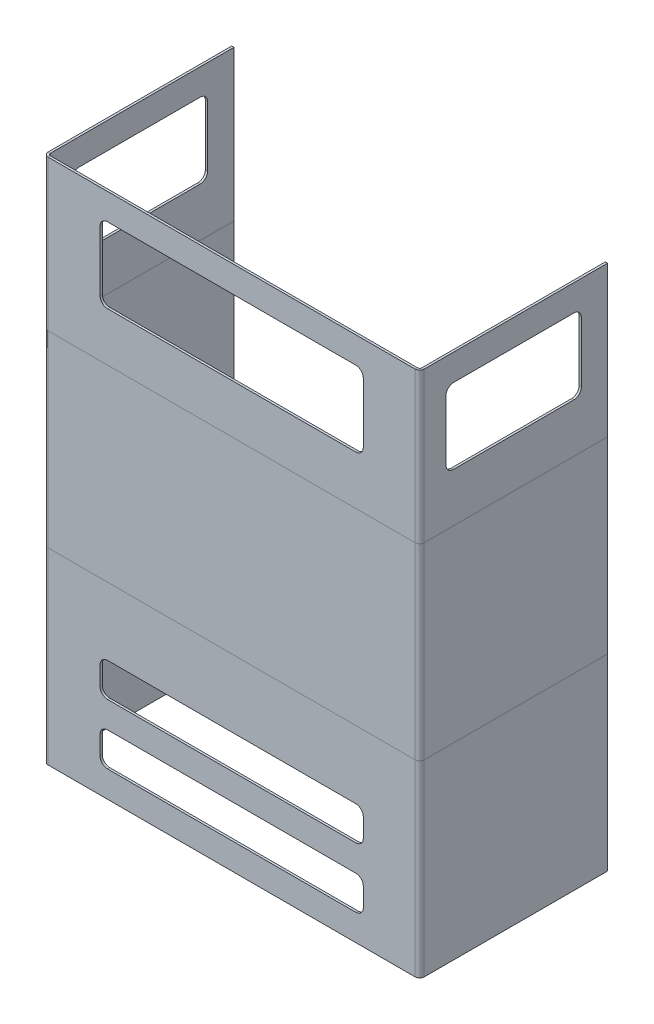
ISO-10303-21;
HEADER;
FILE_DESCRIPTION(('STEP AP214'),'2;1');
FILE_NAME('part.step','',(''),(''),'','','');
FILE_SCHEMA(('AUTOMOTIVE_DESIGN { 1 0 10303 214 1 1 1 1 }'));
ENDSEC;
DATA;
#1=APPLICATION_CONTEXT('core data for automotive mechanical design processes');
#2=APPLICATION_PROTOCOL_DEFINITION('international standard','automotive_design',2000,#1);
#3=PRODUCT_CONTEXT('',#1,'mechanical');
#4=PRODUCT('Part','Part','',(#3));
#5=PRODUCT_RELATED_PRODUCT_CATEGORY('part','',(#4));
#6=PRODUCT_DEFINITION_FORMATION('','',#4);
#7=PRODUCT_DEFINITION_CONTEXT('part definition',#1,'design');
#8=PRODUCT_DEFINITION('design','',#6,#7);
#9=PRODUCT_DEFINITION_SHAPE('','',#8);
#10=(LENGTH_UNIT() NAMED_UNIT(*) SI_UNIT(.MILLI.,.METRE.));
#11=(NAMED_UNIT(*) PLANE_ANGLE_UNIT() SI_UNIT($,.RADIAN.));
#12=(NAMED_UNIT(*) SI_UNIT($,.STERADIAN.) SOLID_ANGLE_UNIT());
#13=UNCERTAINTY_MEASURE_WITH_UNIT(LENGTH_MEASURE(1.E-05),#10,'distance_accuracy_value','');
#14=(GEOMETRIC_REPRESENTATION_CONTEXT(3) GLOBAL_UNCERTAINTY_ASSIGNED_CONTEXT((#13)) GLOBAL_UNIT_ASSIGNED_CONTEXT((#10,
#11,#12)) REPRESENTATION_CONTEXT('',''));
#15=CARTESIAN_POINT('',(0.,0.,0.));
#16=DIRECTION('',(0.,0.,1.));
#17=DIRECTION('',(1.,0.,0.));
#18=AXIS2_PLACEMENT_3D('',#15,#16,#17);
#19=CARTESIAN_POINT('',(0.,250.,0.));
#20=DIRECTION('',(0.,1.,0.));
#21=DIRECTION('',(0.,0.,1.));
#22=AXIS2_PLACEMENT_3D('',#19,#20,#21);
#23=PLANE('',#22);
#24=CARTESIAN_POINT('',(244.,250.,-6.));
#25=DIRECTION('',(0.,1.,0.));
#26=DIRECTION('',(0.,0.,1.));
#27=AXIS2_PLACEMENT_3D('',#24,#25,#26);
#28=CIRCLE('',#27,6.);
#29=CARTESIAN_POINT('',(244.,250.,0.));
#30=VERTEX_POINT('',#29);
#31=CARTESIAN_POINT('',(250.,250.,-6.));
#32=VERTEX_POINT('',#31);
#33=EDGE_CURVE('E218',#30,#32,#28,.T.);
#34=ORIENTED_EDGE('',*,*,#33,.T.);
#35=DIRECTION('',(0.,0.,-1.));
#36=VECTOR('',#35,1.);
#37=CARTESIAN_POINT('',(250.,250.,0.));
#38=LINE('',#37,#36);
#39=CARTESIAN_POINT('',(250.,250.,-250.));
#40=VERTEX_POINT('',#39);
#41=EDGE_CURVE('E230',#32,#40,#38,.T.);
#42=ORIENTED_EDGE('',*,*,#41,.T.);
#43=DIRECTION('',(1.,0.,0.));
#44=VECTOR('',#43,1.);
#45=CARTESIAN_POINT('',(247.,250.,-250.));
#46=LINE('',#45,#44);
#47=CARTESIAN_POINT('',(247.,250.,-250.));
#48=VERTEX_POINT('',#47);
#49=EDGE_CURVE('E233',#48,#40,#46,.T.);
#50=ORIENTED_EDGE('',*,*,#49,.F.);
#51=DIRECTION('',(0.,0.,-1.));
#52=VECTOR('',#51,1.);
#53=CARTESIAN_POINT('',(247.,250.,0.));
#54=LINE('',#53,#52);
#55=CARTESIAN_POINT('',(247.,250.,-6.));
#56=VERTEX_POINT('',#55);
#57=EDGE_CURVE('E236',#56,#48,#54,.T.);
#58=ORIENTED_EDGE('',*,*,#57,.F.);
#59=CARTESIAN_POINT('',(244.,250.,-6.));
#60=DIRECTION('',(0.,1.,0.));
#61=DIRECTION('',(0.,0.,1.));
#62=AXIS2_PLACEMENT_3D('',#59,#60,#61);
#63=CIRCLE('',#62,3.);
#64=CARTESIAN_POINT('',(244.,250.,-3.));
#65=VERTEX_POINT('',#64);
#66=EDGE_CURVE('E239',#65,#56,#63,.T.);
#67=ORIENTED_EDGE('',*,*,#66,.F.);
#68=DIRECTION('',(1.,0.,0.));
#69=VECTOR('',#68,1.);
#70=CARTESIAN_POINT('',(-250.,250.,-3.));
#71=LINE('',#70,#69);
#72=CARTESIAN_POINT('',(-244.,250.,-3.));
#73=VERTEX_POINT('',#72);
#74=EDGE_CURVE('E242',#73,#65,#71,.T.);
#75=ORIENTED_EDGE('',*,*,#74,.F.);
#76=CARTESIAN_POINT('',(-244.,250.,-6.));
#77=DIRECTION('',(0.,1.,0.));
#78=DIRECTION('',(0.,0.,1.));
#79=AXIS2_PLACEMENT_3D('',#76,#77,#78);
#80=CIRCLE('',#79,3.);
#81=CARTESIAN_POINT('',(-247.,250.,-6.));
#82=VERTEX_POINT('',#81);
#83=EDGE_CURVE('E245',#82,#73,#80,.T.);
#84=ORIENTED_EDGE('',*,*,#83,.F.);
#85=DIRECTION('',(0.,0.,1.));
#86=VECTOR('',#85,1.);
#87=CARTESIAN_POINT('',(-247.,250.,-250.));
#88=LINE('',#87,#86);
#89=CARTESIAN_POINT('',(-247.,250.,-250.));
#90=VERTEX_POINT('',#89);
#91=EDGE_CURVE('E247',#90,#82,#88,.T.);
#92=ORIENTED_EDGE('',*,*,#91,.F.);
#93=DIRECTION('',(1.,0.,0.));
#94=VECTOR('',#93,1.);
#95=CARTESIAN_POINT('',(-250.,250.,-250.));
#96=LINE('',#95,#94);
#97=CARTESIAN_POINT('',(-250.,250.,-250.));
#98=VERTEX_POINT('',#97);
#99=EDGE_CURVE('E53',#98,#90,#96,.T.);
#100=ORIENTED_EDGE('',*,*,#99,.F.);
#101=DIRECTION('',(0.,0.,1.));
#102=VECTOR('',#101,1.);
#103=CARTESIAN_POINT('',(-250.,250.,-250.));
#104=LINE('',#103,#102);
#105=CARTESIAN_POINT('',(-250.,250.,-6.00000000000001));
#106=VERTEX_POINT('',#105);
#107=EDGE_CURVE('E227',#98,#106,#104,.T.);
#108=ORIENTED_EDGE('',*,*,#107,.T.);
#109=CARTESIAN_POINT('',(-244.,250.,-6.));
#110=DIRECTION('',(0.,1.,0.));
#111=DIRECTION('',(0.,0.,1.));
#112=AXIS2_PLACEMENT_3D('',#109,#110,#111);
#113=CIRCLE('',#112,6.);
#114=CARTESIAN_POINT('',(-244.,250.,0.));
#115=VERTEX_POINT('',#114);
#116=EDGE_CURVE('E224',#106,#115,#113,.T.);
#117=ORIENTED_EDGE('',*,*,#116,.T.);
#118=DIRECTION('',(1.,0.,0.));
#119=VECTOR('',#118,1.);
#120=CARTESIAN_POINT('',(-250.,250.,0.));
#121=LINE('',#120,#119);
#122=EDGE_CURVE('E221',#115,#30,#121,.T.);
#123=ORIENTED_EDGE('',*,*,#122,.T.);
#124=EDGE_LOOP('',(#34,#42,#50,#58,#67,#75,#84,#92,#100,#108,#117,#123));
#125=FACE_BOUND('',#124,.T.);
#126=ADVANCED_FACE('F49',(#125),#23,.T.);
#127=CARTESIAN_POINT('',(250.,700.,0.));
#128=DIRECTION('',(-1.,0.,0.));
#129=DIRECTION('',(0.,0.,1.));
#130=AXIS2_PLACEMENT_3D('',#127,#128,#129);
#131=PLANE('',#130);
#132=ORIENTED_EDGE('',*,*,#41,.F.);
#133=DIRECTION('',(0.,-1.,0.));
#134=VECTOR('',#133,1.);
#135=CARTESIAN_POINT('',(250.,700.,-6.));
#136=LINE('',#135,#134);
#137=CARTESIAN_POINT('',(250.,0.,-6.));
#138=VERTEX_POINT('',#137);
#139=EDGE_CURVE('E180',#32,#138,#136,.T.);
#140=ORIENTED_EDGE('',*,*,#139,.T.);
#141=DIRECTION('',(0.,0.,-1.));
#142=VECTOR('',#141,1.);
#143=CARTESIAN_POINT('',(250.,0.,0.));
#144=LINE('',#143,#142);
#145=CARTESIAN_POINT('',(250.,0.,-250.));
#146=VERTEX_POINT('',#145);
#147=EDGE_CURVE('E308',#138,#146,#144,.T.);
#148=ORIENTED_EDGE('',*,*,#147,.T.);
#149=DIRECTION('',(0.,-1.,0.));
#150=VECTOR('',#149,1.);
#151=CARTESIAN_POINT('',(250.,700.,-250.));
#152=LINE('',#151,#150);
#153=EDGE_CURVE('E214',#40,#146,#152,.T.);
#154=ORIENTED_EDGE('',*,*,#153,.F.);
#155=EDGE_LOOP('',(#132,#140,#148,#154));
#156=FACE_BOUND('',#155,.T.);
#157=ADVANCED_FACE('F493',(#156),#131,.F.);
#158=CARTESIAN_POINT('',(247.,700.,-250.));
#159=DIRECTION('',(0.,0.,-1.));
#160=DIRECTION('',(-1.,0.,0.));
#161=AXIS2_PLACEMENT_3D('',#158,#159,#160);
#162=PLANE('',#161);
#163=DIRECTION('',(0.,-1.,0.));
#164=VECTOR('',#163,1.);
#165=CARTESIAN_POINT('',(247.,700.,-250.));
#166=LINE('',#165,#164);
#167=CARTESIAN_POINT('',(247.,0.,-250.));
#168=VERTEX_POINT('',#167);
#169=EDGE_CURVE('E211',#48,#168,#166,.T.);
#170=ORIENTED_EDGE('',*,*,#169,.F.);
#171=ORIENTED_EDGE('',*,*,#49,.T.);
#172=ORIENTED_EDGE('',*,*,#153,.T.);
#173=DIRECTION('',(1.,0.,0.));
#174=VECTOR('',#173,1.);
#175=CARTESIAN_POINT('',(247.,0.,-250.));
#176=LINE('',#175,#174);
#177=EDGE_CURVE('E305',#168,#146,#176,.T.);
#178=ORIENTED_EDGE('',*,*,#177,.F.);
#179=EDGE_LOOP('',(#170,#171,#172,#178));
#180=FACE_BOUND('',#179,.T.);
#181=ADVANCED_FACE('F495',(#180),#162,.T.);
#182=CARTESIAN_POINT('',(247.,700.,0.));
#183=DIRECTION('',(-1.,0.,0.));
#184=DIRECTION('',(0.,0.,1.));
#185=AXIS2_PLACEMENT_3D('',#182,#183,#184);
#186=PLANE('',#185);
#187=DIRECTION('',(0.,-1.,0.));
#188=VECTOR('',#187,1.);
#189=CARTESIAN_POINT('',(247.,700.,-6.));
#190=LINE('',#189,#188);
#191=CARTESIAN_POINT('',(247.,0.,-6.));
#192=VERTEX_POINT('',#191);
#193=EDGE_CURVE('E208',#56,#192,#190,.T.);
#194=ORIENTED_EDGE('',*,*,#193,.F.);
#195=ORIENTED_EDGE('',*,*,#57,.T.);
#196=ORIENTED_EDGE('',*,*,#169,.T.);
#197=DIRECTION('',(0.,0.,-1.));
#198=VECTOR('',#197,1.);
#199=CARTESIAN_POINT('',(247.,0.,0.));
#200=LINE('',#199,#198);
#201=EDGE_CURVE('E302',#192,#168,#200,.T.);
#202=ORIENTED_EDGE('',*,*,#201,.F.);
#203=EDGE_LOOP('',(#194,#195,#196,#202));
#204=FACE_BOUND('',#203,.T.);
#205=ADVANCED_FACE('F502',(#204),#186,.T.);
#206=CARTESIAN_POINT('',(244.,700.,-6.));
#207=DIRECTION('',(0.,-1.,0.));
#208=DIRECTION('',(0.,0.,-1.));
#209=AXIS2_PLACEMENT_3D('',#206,#207,#208);
#210=CYLINDRICAL_SURFACE('',#209,3.);
#211=DIRECTION('',(0.,-1.,0.));
#212=VECTOR('',#211,1.);
#213=CARTESIAN_POINT('',(244.,700.,-3.));
#214=LINE('',#213,#212);
#215=CARTESIAN_POINT('',(244.,0.,-3.));
#216=VERTEX_POINT('',#215);
#217=EDGE_CURVE('E205',#65,#216,#214,.T.);
#218=ORIENTED_EDGE('',*,*,#217,.F.);
#219=ORIENTED_EDGE('',*,*,#66,.T.);
#220=ORIENTED_EDGE('',*,*,#193,.T.);
#221=CARTESIAN_POINT('',(244.,0.,-6.));
#222=DIRECTION('',(0.,1.,0.));
#223=DIRECTION('',(1.,0.,0.));
#224=AXIS2_PLACEMENT_3D('',#221,#222,#223);
#225=CIRCLE('',#224,3.);
#226=EDGE_CURVE('E299',#216,#192,#225,.T.);
#227=ORIENTED_EDGE('',*,*,#226,.F.);
#228=EDGE_LOOP('',(#218,#219,#220,#227));
#229=FACE_BOUND('',#228,.T.);
#230=ADVANCED_FACE('F552',(#229),#210,.F.);
#231=CARTESIAN_POINT('',(-250.,700.,-3.));
#232=DIRECTION('',(0.,0.,-1.));
#233=DIRECTION('',(-1.,0.,0.));
#234=AXIS2_PLACEMENT_3D('',#231,#232,#233);
#235=PLANE('',#234);
#236=CARTESIAN_POINT('',(-165.,125.,-3.));
#237=DIRECTION('',(0.,0.,1.));
#238=DIRECTION('',(1.,0.,0.));
#239=AXIS2_PLACEMENT_3D('',#236,#237,#238);
#240=CIRCLE('',#239,10.);
#241=CARTESIAN_POINT('',(-175.,125.,-3.));
#242=VERTEX_POINT('',#241);
#243=CARTESIAN_POINT('',(-165.,115.,-3.));
#244=VERTEX_POINT('',#243);
#245=EDGE_CURVE('E338',#242,#244,#240,.T.);
#246=ORIENTED_EDGE('',*,*,#245,.T.);
#247=DIRECTION('',(1.,0.,0.));
#248=VECTOR('',#247,1.);
#249=CARTESIAN_POINT('',(-165.,115.,-3.));
#250=LINE('',#249,#248);
#251=CARTESIAN_POINT('',(165.,115.,-3.));
#252=VERTEX_POINT('',#251);
#253=EDGE_CURVE('E370',#244,#252,#250,.T.);
#254=ORIENTED_EDGE('',*,*,#253,.T.);
#255=CARTESIAN_POINT('',(165.,125.,-3.));
#256=DIRECTION('',(0.,0.,1.));
#257=DIRECTION('',(1.,0.,0.));
#258=AXIS2_PLACEMENT_3D('',#255,#256,#257);
#259=CIRCLE('',#258,10.);
#260=CARTESIAN_POINT('',(175.,125.,-3.));
#261=VERTEX_POINT('',#260);
#262=EDGE_CURVE('E367',#252,#261,#259,.T.);
#263=ORIENTED_EDGE('',*,*,#262,.T.);
#264=DIRECTION('',(0.,1.,0.));
#265=VECTOR('',#264,1.);
#266=CARTESIAN_POINT('',(175.,150.,-3.));
#267=LINE('',#266,#265);
#268=CARTESIAN_POINT('',(175.,150.,-3.));
#269=VERTEX_POINT('',#268);
#270=EDGE_CURVE('E364',#261,#269,#267,.T.);
#271=ORIENTED_EDGE('',*,*,#270,.T.);
#272=CARTESIAN_POINT('',(165.,150.,-3.));
#273=DIRECTION('',(0.,0.,1.));
#274=DIRECTION('',(-1.,0.,0.));
#275=AXIS2_PLACEMENT_3D('',#272,#273,#274);
#276=CIRCLE('',#275,10.);
#277=CARTESIAN_POINT('',(165.,160.,-3.));
#278=VERTEX_POINT('',#277);
#279=EDGE_CURVE('E361',#269,#278,#276,.T.);
#280=ORIENTED_EDGE('',*,*,#279,.T.);
#281=DIRECTION('',(-1.,0.,0.));
#282=VECTOR('',#281,1.);
#283=CARTESIAN_POINT('',(-165.,160.,-3.));
#284=LINE('',#283,#282);
#285=CARTESIAN_POINT('',(-165.,160.,-3.));
#286=VERTEX_POINT('',#285);
#287=EDGE_CURVE('E358',#278,#286,#284,.T.);
#288=ORIENTED_EDGE('',*,*,#287,.T.);
#289=CARTESIAN_POINT('',(-165.,150.,-3.));
#290=DIRECTION('',(0.,0.,1.));
#291=DIRECTION('',(1.,0.,0.));
#292=AXIS2_PLACEMENT_3D('',#289,#290,#291);
#293=CIRCLE('',#292,10.);
#294=CARTESIAN_POINT('',(-175.,150.,-3.));
#295=VERTEX_POINT('',#294);
#296=EDGE_CURVE('E355',#286,#295,#293,.T.);
#297=ORIENTED_EDGE('',*,*,#296,.T.);
#298=DIRECTION('',(0.,-1.,0.));
#299=VECTOR('',#298,1.);
#300=CARTESIAN_POINT('',(-175.,150.,-3.));
#301=LINE('',#300,#299);
#302=EDGE_CURVE('E315',#295,#242,#301,.T.);
#303=ORIENTED_EDGE('',*,*,#302,.T.);
#304=EDGE_LOOP('',(#246,#254,#263,#271,#280,#288,#297,#303));
#305=FACE_BOUND('',#304,.T.);
#306=CARTESIAN_POINT('',(-165.,45.,-3.));
#307=DIRECTION('',(0.,0.,1.));
#308=DIRECTION('',(1.,0.,0.));
#309=AXIS2_PLACEMENT_3D('',#306,#307,#308);
#310=CIRCLE('',#309,10.);
#311=CARTESIAN_POINT('',(-175.,45.,-3.));
#312=VERTEX_POINT('',#311);
#313=CARTESIAN_POINT('',(-165.,35.,-3.));
#314=VERTEX_POINT('',#313);
#315=EDGE_CURVE('E149',#312,#314,#310,.T.);
#316=ORIENTED_EDGE('',*,*,#315,.T.);
#317=DIRECTION('',(1.,0.,0.));
#318=VECTOR('',#317,1.);
#319=CARTESIAN_POINT('',(-165.,35.,-3.));
#320=LINE('',#319,#318);
#321=CARTESIAN_POINT('',(165.,35.,-3.));
#322=VERTEX_POINT('',#321);
#323=EDGE_CURVE('E162',#314,#322,#320,.T.);
#324=ORIENTED_EDGE('',*,*,#323,.T.);
#325=CARTESIAN_POINT('',(165.,45.,-3.));
#326=DIRECTION('',(0.,0.,1.));
#327=DIRECTION('',(1.,0.,0.));
#328=AXIS2_PLACEMENT_3D('',#325,#326,#327);
#329=CIRCLE('',#328,10.);
#330=CARTESIAN_POINT('',(175.,45.,-3.));
#331=VERTEX_POINT('',#330);
#332=EDGE_CURVE('E167',#322,#331,#329,.T.);
#333=ORIENTED_EDGE('',*,*,#332,.T.);
#334=DIRECTION('',(0.,1.,0.));
#335=VECTOR('',#334,1.);
#336=CARTESIAN_POINT('',(175.,70.,-3.));
#337=LINE('',#336,#335);
#338=CARTESIAN_POINT('',(175.,70.,-3.));
#339=VERTEX_POINT('',#338);
#340=EDGE_CURVE('E411',#331,#339,#337,.T.);
#341=ORIENTED_EDGE('',*,*,#340,.T.);
#342=CARTESIAN_POINT('',(165.,70.,-3.));
#343=DIRECTION('',(0.,0.,1.));
#344=DIRECTION('',(-1.,0.,0.));
#345=AXIS2_PLACEMENT_3D('',#342,#343,#344);
#346=CIRCLE('',#345,10.);
#347=CARTESIAN_POINT('',(165.,80.,-3.));
#348=VERTEX_POINT('',#347);
#349=EDGE_CURVE('E408',#339,#348,#346,.T.);
#350=ORIENTED_EDGE('',*,*,#349,.T.);
#351=DIRECTION('',(-1.,0.,0.));
#352=VECTOR('',#351,1.);
#353=CARTESIAN_POINT('',(-165.,80.,-3.));
#354=LINE('',#353,#352);
#355=CARTESIAN_POINT('',(-165.,80.,-3.));
#356=VERTEX_POINT('',#355);
#357=EDGE_CURVE('E405',#348,#356,#354,.T.);
#358=ORIENTED_EDGE('',*,*,#357,.T.);
#359=CARTESIAN_POINT('',(-165.,70.,-3.));
#360=DIRECTION('',(0.,0.,1.));
#361=DIRECTION('',(1.,0.,0.));
#362=AXIS2_PLACEMENT_3D('',#359,#360,#361);
#363=CIRCLE('',#362,10.);
#364=CARTESIAN_POINT('',(-175.,70.,-3.));
#365=VERTEX_POINT('',#364);
#366=EDGE_CURVE('E403',#356,#365,#363,.T.);
#367=ORIENTED_EDGE('',*,*,#366,.T.);
#368=DIRECTION('',(0.,-1.,0.));
#369=VECTOR('',#368,1.);
#370=CARTESIAN_POINT('',(-175.,70.,-3.));
#371=LINE('',#370,#369);
#372=EDGE_CURVE('E157',#365,#312,#371,.T.);
#373=ORIENTED_EDGE('',*,*,#372,.T.);
#374=EDGE_LOOP('',(#316,#324,#333,#341,#350,#358,#367,#373));
#375=FACE_BOUND('',#374,.T.);
#376=DIRECTION('',(0.,-1.,0.));
#377=VECTOR('',#376,1.);
#378=CARTESIAN_POINT('',(-244.,700.,-3.));
#379=LINE('',#378,#377);
#380=CARTESIAN_POINT('',(-244.,0.,-3.));
#381=VERTEX_POINT('',#380);
#382=EDGE_CURVE('E202',#73,#381,#379,.T.);
#383=ORIENTED_EDGE('',*,*,#382,.F.);
#384=ORIENTED_EDGE('',*,*,#74,.T.);
#385=ORIENTED_EDGE('',*,*,#217,.T.);
#386=DIRECTION('',(1.,0.,0.));
#387=VECTOR('',#386,1.);
#388=CARTESIAN_POINT('',(-250.,0.,-3.));
#389=LINE('',#388,#387);
#390=EDGE_CURVE('E297',#381,#216,#389,.T.);
#391=ORIENTED_EDGE('',*,*,#390,.F.);
#392=EDGE_LOOP('',(#383,#384,#385,#391));
#393=FACE_BOUND('',#392,.T.);
#394=ADVANCED_FACE('F169',(#305,#375,#393),#235,.T.);
#395=CARTESIAN_POINT('',(-244.,700.,-6.));
#396=DIRECTION('',(0.,-1.,0.));
#397=DIRECTION('',(0.,0.,-1.));
#398=AXIS2_PLACEMENT_3D('',#395,#396,#397);
#399=CYLINDRICAL_SURFACE('',#398,3.);
#400=DIRECTION('',(0.,-1.,0.));
#401=VECTOR('',#400,1.);
#402=CARTESIAN_POINT('',(-247.,700.,-6.));
#403=LINE('',#402,#401);
#404=CARTESIAN_POINT('',(-247.,0.,-6.));
#405=VERTEX_POINT('',#404);
#406=EDGE_CURVE('E199',#82,#405,#403,.T.);
#407=ORIENTED_EDGE('',*,*,#406,.F.);
#408=ORIENTED_EDGE('',*,*,#83,.T.);
#409=ORIENTED_EDGE('',*,*,#382,.T.);
#410=CARTESIAN_POINT('',(-244.,0.,-6.));
#411=DIRECTION('',(0.,1.,0.));
#412=DIRECTION('',(1.,0.,0.));
#413=AXIS2_PLACEMENT_3D('',#410,#411,#412);
#414=CIRCLE('',#413,3.);
#415=EDGE_CURVE('E294',#405,#381,#414,.T.);
#416=ORIENTED_EDGE('',*,*,#415,.F.);
#417=EDGE_LOOP('',(#407,#408,#409,#416));
#418=FACE_BOUND('',#417,.T.);
#419=ADVANCED_FACE('F559',(#418),#399,.F.);
#420=CARTESIAN_POINT('',(-247.,700.,-250.));
#421=DIRECTION('',(1.,0.,0.));
#422=DIRECTION('',(0.,0.,-1.));
#423=AXIS2_PLACEMENT_3D('',#420,#421,#422);
#424=PLANE('',#423);
#425=DIRECTION('',(0.,-1.,0.));
#426=VECTOR('',#425,1.);
#427=CARTESIAN_POINT('',(-247.,700.,-250.));
#428=LINE('',#427,#426);
#429=CARTESIAN_POINT('',(-247.,0.,-250.));
#430=VERTEX_POINT('',#429);
#431=EDGE_CURVE('E196',#90,#430,#428,.T.);
#432=ORIENTED_EDGE('',*,*,#431,.F.);
#433=ORIENTED_EDGE('',*,*,#91,.T.);
#434=ORIENTED_EDGE('',*,*,#406,.T.);
#435=DIRECTION('',(0.,0.,-1.));
#436=VECTOR('',#435,1.);
#437=CARTESIAN_POINT('',(-247.,0.,-250.));
#438=LINE('',#437,#436);
#439=EDGE_CURVE('E291',#430,#405,#438,.F.);
#440=ORIENTED_EDGE('',*,*,#439,.F.);
#441=EDGE_LOOP('',(#432,#433,#434,#440));
#442=FACE_BOUND('',#441,.T.);
#443=ADVANCED_FACE('F562',(#442),#424,.T.);
#444=CARTESIAN_POINT('',(-250.,700.,-250.));
#445=DIRECTION('',(0.,0.,-1.));
#446=DIRECTION('',(-1.,0.,0.));
#447=AXIS2_PLACEMENT_3D('',#444,#445,#446);
#448=PLANE('',#447);
#449=DIRECTION('',(0.,-1.,0.));
#450=VECTOR('',#449,1.);
#451=CARTESIAN_POINT('',(-250.,700.,-250.));
#452=LINE('',#451,#450);
#453=CARTESIAN_POINT('',(-250.,0.,-250.));
#454=VERTEX_POINT('',#453);
#455=EDGE_CURVE('E193',#98,#454,#452,.T.);
#456=ORIENTED_EDGE('',*,*,#455,.F.);
#457=ORIENTED_EDGE('',*,*,#99,.T.);
#458=ORIENTED_EDGE('',*,*,#431,.T.);
#459=DIRECTION('',(1.,0.,0.));
#460=VECTOR('',#459,1.);
#461=CARTESIAN_POINT('',(-250.,0.,-250.));
#462=LINE('',#461,#460);
#463=EDGE_CURVE('E288',#454,#430,#462,.T.);
#464=ORIENTED_EDGE('',*,*,#463,.F.);
#465=EDGE_LOOP('',(#456,#457,#458,#464));
#466=FACE_BOUND('',#465,.T.);
#467=ADVANCED_FACE('F566',(#466),#448,.T.);
#468=CARTESIAN_POINT('',(-250.,700.,-250.));
#469=DIRECTION('',(1.,0.,0.));
#470=DIRECTION('',(0.,0.,-1.));
#471=AXIS2_PLACEMENT_3D('',#468,#469,#470);
#472=PLANE('',#471);
#473=ORIENTED_EDGE('',*,*,#107,.F.);
#474=ORIENTED_EDGE('',*,*,#455,.T.);
#475=DIRECTION('',(0.,0.,1.));
#476=VECTOR('',#475,1.);
#477=CARTESIAN_POINT('',(-250.,0.,-250.));
#478=LINE('',#477,#476);
#479=CARTESIAN_POINT('',(-250.,0.,-6.00000000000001));
#480=VERTEX_POINT('',#479);
#481=EDGE_CURVE('E285',#454,#480,#478,.T.);
#482=ORIENTED_EDGE('',*,*,#481,.T.);
#483=DIRECTION('',(0.,-1.,0.));
#484=VECTOR('',#483,1.);
#485=CARTESIAN_POINT('',(-250.,700.,-6.00000000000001));
#486=LINE('',#485,#484);
#487=EDGE_CURVE('E190',#106,#480,#486,.T.);
#488=ORIENTED_EDGE('',*,*,#487,.F.);
#489=EDGE_LOOP('',(#473,#474,#482,#488));
#490=FACE_BOUND('',#489,.T.);
#491=ADVANCED_FACE('F519',(#490),#472,.F.);
#492=CARTESIAN_POINT('',(-244.,700.,-6.));
#493=DIRECTION('',(0.,-1.,0.));
#494=DIRECTION('',(0.,0.,-1.));
#495=AXIS2_PLACEMENT_3D('',#492,#493,#494);
#496=CYLINDRICAL_SURFACE('',#495,6.);
#497=ORIENTED_EDGE('',*,*,#116,.F.);
#498=ORIENTED_EDGE('',*,*,#487,.T.);
#499=CARTESIAN_POINT('',(-244.,0.,-6.));
#500=DIRECTION('',(0.,-1.,0.));
#501=DIRECTION('',(0.,0.,-1.));
#502=AXIS2_PLACEMENT_3D('',#499,#500,#501);
#503=CIRCLE('',#502,6.);
#504=CARTESIAN_POINT('',(-244.,0.,0.));
#505=VERTEX_POINT('',#504);
#506=EDGE_CURVE('E282',#480,#505,#503,.F.);
#507=ORIENTED_EDGE('',*,*,#506,.T.);
#508=DIRECTION('',(0.,-1.,0.));
#509=VECTOR('',#508,1.);
#510=CARTESIAN_POINT('',(-244.,700.,0.));
#511=LINE('',#510,#509);
#512=EDGE_CURVE('E187',#115,#505,#511,.T.);
#513=ORIENTED_EDGE('',*,*,#512,.F.);
#514=EDGE_LOOP('',(#497,#498,#507,#513));
#515=FACE_BOUND('',#514,.T.);
#516=ADVANCED_FACE('F509',(#515),#496,.T.);
#517=CARTESIAN_POINT('',(-250.,700.,0.));
#518=DIRECTION('',(0.,0.,-1.));
#519=DIRECTION('',(-1.,0.,0.));
#520=AXIS2_PLACEMENT_3D('',#517,#518,#519);
#521=PLANE('',#520);
#522=DIRECTION('',(1.,0.,0.));
#523=VECTOR('',#522,1.);
#524=CARTESIAN_POINT('',(-165.,35.,0.));
#525=LINE('',#524,#523);
#526=CARTESIAN_POINT('',(-165.,35.,0.));
#527=VERTEX_POINT('',#526);
#528=CARTESIAN_POINT('',(165.,35.,0.));
#529=VERTEX_POINT('',#528);
#530=EDGE_CURVE('E399',#527,#529,#525,.T.);
#531=ORIENTED_EDGE('',*,*,#530,.F.);
#532=CARTESIAN_POINT('',(-165.,45.,0.));
#533=DIRECTION('',(0.,0.,1.));
#534=DIRECTION('',(1.,0.,0.));
#535=AXIS2_PLACEMENT_3D('',#532,#533,#534);
#536=CIRCLE('',#535,10.);
#537=CARTESIAN_POINT('',(-175.,45.,0.));
#538=VERTEX_POINT('',#537);
#539=EDGE_CURVE('E153',#538,#527,#536,.T.);
#540=ORIENTED_EDGE('',*,*,#539,.F.);
#541=DIRECTION('',(0.,-1.,0.));
#542=VECTOR('',#541,1.);
#543=CARTESIAN_POINT('',(-175.,70.,0.));
#544=LINE('',#543,#542);
#545=CARTESIAN_POINT('',(-175.,70.,0.));
#546=VERTEX_POINT('',#545);
#547=EDGE_CURVE('E173',#546,#538,#544,.T.);
#548=ORIENTED_EDGE('',*,*,#547,.F.);
#549=CARTESIAN_POINT('',(-165.,70.,0.));
#550=DIRECTION('',(0.,0.,1.));
#551=DIRECTION('',(1.,0.,0.));
#552=AXIS2_PLACEMENT_3D('',#549,#550,#551);
#553=CIRCLE('',#552,10.);
#554=CARTESIAN_POINT('',(-165.,80.,0.));
#555=VERTEX_POINT('',#554);
#556=EDGE_CURVE('E176',#555,#546,#553,.T.);
#557=ORIENTED_EDGE('',*,*,#556,.F.);
#558=DIRECTION('',(-1.,0.,0.));
#559=VECTOR('',#558,1.);
#560=CARTESIAN_POINT('',(-165.,80.,0.));
#561=LINE('',#560,#559);
#562=CARTESIAN_POINT('',(165.,80.,0.));
#563=VERTEX_POINT('',#562);
#564=EDGE_CURVE('E388',#563,#555,#561,.T.);
#565=ORIENTED_EDGE('',*,*,#564,.F.);
#566=CARTESIAN_POINT('',(165.,70.,0.));
#567=DIRECTION('',(0.,0.,1.));
#568=DIRECTION('',(-1.,0.,0.));
#569=AXIS2_PLACEMENT_3D('',#566,#567,#568);
#570=CIRCLE('',#569,10.);
#571=CARTESIAN_POINT('',(175.,70.,0.));
#572=VERTEX_POINT('',#571);
#573=EDGE_CURVE('E391',#572,#563,#570,.T.);
#574=ORIENTED_EDGE('',*,*,#573,.F.);
#575=DIRECTION('',(0.,1.,0.));
#576=VECTOR('',#575,1.);
#577=CARTESIAN_POINT('',(175.,70.,0.));
#578=LINE('',#577,#576);
#579=CARTESIAN_POINT('',(175.,45.,0.));
#580=VERTEX_POINT('',#579);
#581=EDGE_CURVE('E394',#580,#572,#578,.T.);
#582=ORIENTED_EDGE('',*,*,#581,.F.);
#583=CARTESIAN_POINT('',(165.,45.,0.));
#584=DIRECTION('',(0.,0.,1.));
#585=DIRECTION('',(1.,0.,0.));
#586=AXIS2_PLACEMENT_3D('',#583,#584,#585);
#587=CIRCLE('',#586,10.);
#588=EDGE_CURVE('E397',#529,#580,#587,.T.);
#589=ORIENTED_EDGE('',*,*,#588,.F.);
#590=EDGE_LOOP('',(#531,#540,#548,#557,#565,#574,#582,#589));
#591=FACE_BOUND('',#590,.T.);
#592=DIRECTION('',(1.,0.,0.));
#593=VECTOR('',#592,1.);
#594=CARTESIAN_POINT('',(-165.,115.,0.));
#595=LINE('',#594,#593);
#596=CARTESIAN_POINT('',(-165.,115.,0.));
#597=VERTEX_POINT('',#596);
#598=CARTESIAN_POINT('',(165.,115.,0.));
#599=VERTEX_POINT('',#598);
#600=EDGE_CURVE('E59',#597,#599,#595,.T.);
#601=ORIENTED_EDGE('',*,*,#600,.F.);
#602=CARTESIAN_POINT('',(-165.,125.,0.));
#603=DIRECTION('',(0.,0.,1.));
#604=DIRECTION('',(1.,0.,0.));
#605=AXIS2_PLACEMENT_3D('',#602,#603,#604);
#606=CIRCLE('',#605,10.);
#607=CARTESIAN_POINT('',(-175.,125.,0.));
#608=VERTEX_POINT('',#607);
#609=EDGE_CURVE('E12',#608,#597,#606,.T.);
#610=ORIENTED_EDGE('',*,*,#609,.F.);
#611=DIRECTION('',(0.,-1.,0.));
#612=VECTOR('',#611,1.);
#613=CARTESIAN_POINT('',(-175.,150.,0.));
#614=LINE('',#613,#612);
#615=CARTESIAN_POINT('',(-175.,150.,0.));
#616=VERTEX_POINT('',#615);
#617=EDGE_CURVE('E334',#616,#608,#614,.T.);
#618=ORIENTED_EDGE('',*,*,#617,.F.);
#619=CARTESIAN_POINT('',(-165.,150.,0.));
#620=DIRECTION('',(0.,0.,1.));
#621=DIRECTION('',(1.,0.,0.));
#622=AXIS2_PLACEMENT_3D('',#619,#620,#621);
#623=CIRCLE('',#622,10.);
#624=CARTESIAN_POINT('',(-165.,160.,0.));
#625=VERTEX_POINT('',#624);
#626=EDGE_CURVE('E337',#625,#616,#623,.T.);
#627=ORIENTED_EDGE('',*,*,#626,.F.);
#628=DIRECTION('',(-1.,0.,0.));
#629=VECTOR('',#628,1.);
#630=CARTESIAN_POINT('',(-165.,160.,0.));
#631=LINE('',#630,#629);
#632=CARTESIAN_POINT('',(165.,160.,0.));
#633=VERTEX_POINT('',#632);
#634=EDGE_CURVE('E341',#633,#625,#631,.T.);
#635=ORIENTED_EDGE('',*,*,#634,.F.);
#636=CARTESIAN_POINT('',(165.,150.,0.));
#637=DIRECTION('',(0.,0.,1.));
#638=DIRECTION('',(-1.,0.,0.));
#639=AXIS2_PLACEMENT_3D('',#636,#637,#638);
#640=CIRCLE('',#639,10.);
#641=CARTESIAN_POINT('',(175.,150.,0.));
#642=VERTEX_POINT('',#641);
#643=EDGE_CURVE('E344',#642,#633,#640,.T.);
#644=ORIENTED_EDGE('',*,*,#643,.F.);
#645=DIRECTION('',(0.,1.,0.));
#646=VECTOR('',#645,1.);
#647=CARTESIAN_POINT('',(175.,150.,0.));
#648=LINE('',#647,#646);
#649=CARTESIAN_POINT('',(175.,125.,0.));
#650=VERTEX_POINT('',#649);
#651=EDGE_CURVE('E347',#650,#642,#648,.T.);
#652=ORIENTED_EDGE('',*,*,#651,.F.);
#653=CARTESIAN_POINT('',(165.,125.,0.));
#654=DIRECTION('',(0.,0.,1.));
#655=DIRECTION('',(1.,0.,0.));
#656=AXIS2_PLACEMENT_3D('',#653,#654,#655);
#657=CIRCLE('',#656,10.);
#658=EDGE_CURVE('E350',#599,#650,#657,.T.);
#659=ORIENTED_EDGE('',*,*,#658,.F.);
#660=EDGE_LOOP('',(#601,#610,#618,#627,#635,#644,#652,#659));
#661=FACE_BOUND('',#660,.T.);
#662=ORIENTED_EDGE('',*,*,#122,.F.);
#663=ORIENTED_EDGE('',*,*,#512,.T.);
#664=DIRECTION('',(1.,0.,0.));
#665=VECTOR('',#664,1.);
#666=CARTESIAN_POINT('',(-250.,0.,0.));
#667=LINE('',#666,#665);
#668=CARTESIAN_POINT('',(244.,0.,0.));
#669=VERTEX_POINT('',#668);
#670=EDGE_CURVE('E279',#505,#669,#667,.T.);
#671=ORIENTED_EDGE('',*,*,#670,.T.);
#672=DIRECTION('',(0.,-1.,0.));
#673=VECTOR('',#672,1.);
#674=CARTESIAN_POINT('',(244.,700.,0.));
#675=LINE('',#674,#673);
#676=EDGE_CURVE('E184',#30,#669,#675,.T.);
#677=ORIENTED_EDGE('',*,*,#676,.F.);
#678=EDGE_LOOP('',(#662,#663,#671,#677));
#679=FACE_BOUND('',#678,.T.);
#680=ADVANCED_FACE('F463',(#591,#661,#679),#521,.F.);
#681=CARTESIAN_POINT('',(244.,700.,-6.));
#682=DIRECTION('',(0.,-1.,0.));
#683=DIRECTION('',(0.,0.,-1.));
#684=AXIS2_PLACEMENT_3D('',#681,#682,#683);
#685=CYLINDRICAL_SURFACE('',#684,6.);
#686=ORIENTED_EDGE('',*,*,#33,.F.);
#687=ORIENTED_EDGE('',*,*,#676,.T.);
#688=CARTESIAN_POINT('',(244.,0.,-6.));
#689=DIRECTION('',(0.,-1.,0.));
#690=DIRECTION('',(0.,0.,-1.));
#691=AXIS2_PLACEMENT_3D('',#688,#689,#690);
#692=CIRCLE('',#691,6.);
#693=EDGE_CURVE('E183',#669,#138,#692,.F.);
#694=ORIENTED_EDGE('',*,*,#693,.T.);
#695=ORIENTED_EDGE('',*,*,#139,.F.);
#696=EDGE_LOOP('',(#686,#687,#694,#695));
#697=FACE_BOUND('',#696,.T.);
#698=ADVANCED_FACE('F51',(#697),#685,.T.);
#699=CARTESIAN_POINT('',(-244.,0.,0.));
#700=DIRECTION('',(0.,-1.,0.));
#701=DIRECTION('',(0.,0.,-1.));
#702=AXIS2_PLACEMENT_3D('',#699,#700,#701);
#703=PLANE('',#702);
#704=DIRECTION('',(0.,0.,-1.));
#705=VECTOR('',#704,1.);
#706=CARTESIAN_POINT('',(-244.,0.,0.));
#707=LINE('',#706,#705);
#708=EDGE_CURVE('E255',#505,#381,#707,.T.);
#709=ORIENTED_EDGE('',*,*,#708,.F.);
#710=ORIENTED_EDGE('',*,*,#506,.F.);
#711=DIRECTION('',(-1.,0.,0.));
#712=VECTOR('',#711,1.);
#713=CARTESIAN_POINT('',(-247.,0.,-6.));
#714=LINE('',#713,#712);
#715=EDGE_CURVE('E261',#405,#480,#714,.T.);
#716=ORIENTED_EDGE('',*,*,#715,.F.);
#717=ORIENTED_EDGE('',*,*,#415,.T.);
#718=EDGE_LOOP('',(#709,#710,#716,#717));
#719=FACE_BOUND('',#718,.T.);
#720=ADVANCED_FACE('F517',(#719),#703,.T.);
#721=CARTESIAN_POINT('',(-247.,0.,-6.));
#722=DIRECTION('',(0.,-1.,0.));
#723=DIRECTION('',(0.,0.,-1.));
#724=AXIS2_PLACEMENT_3D('',#721,#722,#723);
#725=PLANE('',#724);
#726=ORIENTED_EDGE('',*,*,#670,.F.);
#727=ORIENTED_EDGE('',*,*,#708,.T.);
#728=ORIENTED_EDGE('',*,*,#390,.T.);
#729=DIRECTION('',(0.,0.,1.));
#730=VECTOR('',#729,1.);
#731=CARTESIAN_POINT('',(244.,0.,-3.));
#732=LINE('',#731,#730);
#733=EDGE_CURVE('E217',#216,#669,#732,.T.);
#734=ORIENTED_EDGE('',*,*,#733,.T.);
#735=EDGE_LOOP('',(#726,#727,#728,#734));
#736=FACE_BOUND('',#735,.T.);
#737=ADVANCED_FACE('F772',(#736),#725,.T.);
#738=CARTESIAN_POINT('',(250.,0.,-6.));
#739=DIRECTION('',(0.,-1.,0.));
#740=DIRECTION('',(0.,0.,-1.));
#741=AXIS2_PLACEMENT_3D('',#738,#739,#740);
#742=PLANE('',#741);
#743=DIRECTION('',(-1.,0.,0.));
#744=VECTOR('',#743,1.);
#745=CARTESIAN_POINT('',(250.,0.,-6.));
#746=LINE('',#745,#744);
#747=EDGE_CURVE('E270',#138,#192,#746,.T.);
#748=ORIENTED_EDGE('',*,*,#747,.F.);
#749=ORIENTED_EDGE('',*,*,#693,.F.);
#750=ORIENTED_EDGE('',*,*,#733,.F.);
#751=ORIENTED_EDGE('',*,*,#226,.T.);
#752=EDGE_LOOP('',(#748,#749,#750,#751));
#753=FACE_BOUND('',#752,.T.);
#754=ADVANCED_FACE('F606',(#753),#742,.T.);
#755=CARTESIAN_POINT('',(244.,0.,-3.));
#756=DIRECTION('',(0.,-1.,0.));
#757=DIRECTION('',(0.,0.,-1.));
#758=AXIS2_PLACEMENT_3D('',#755,#756,#757);
#759=PLANE('',#758);
#760=ORIENTED_EDGE('',*,*,#147,.F.);
#761=ORIENTED_EDGE('',*,*,#747,.T.);
#762=ORIENTED_EDGE('',*,*,#201,.T.);
#763=ORIENTED_EDGE('',*,*,#177,.T.);
#764=EDGE_LOOP('',(#760,#761,#762,#763));
#765=FACE_BOUND('',#764,.T.);
#766=ADVANCED_FACE('F599',(#765),#759,.T.);
#767=CARTESIAN_POINT('',(244.,0.,-6.));
#768=DIRECTION('',(0.,1.,0.));
#769=DIRECTION('',(1.,0.,0.));
#770=AXIS2_PLACEMENT_3D('',#767,#768,#769);
#771=PLANE('',#770);
#772=ORIENTED_EDGE('',*,*,#439,.T.);
#773=ORIENTED_EDGE('',*,*,#715,.T.);
#774=ORIENTED_EDGE('',*,*,#481,.F.);
#775=ORIENTED_EDGE('',*,*,#463,.T.);
#776=EDGE_LOOP('',(#772,#773,#774,#775));
#777=FACE_BOUND('',#776,.T.);
#778=ADVANCED_FACE('F596',(#777),#771,.F.);
#779=CARTESIAN_POINT('',(-165.,125.,-3.));
#780=DIRECTION('',(0.,0.,1.));
#781=DIRECTION('',(1.,0.,0.));
#782=AXIS2_PLACEMENT_3D('',#779,#780,#781);
#783=CYLINDRICAL_SURFACE('',#782,10.);
#784=ORIENTED_EDGE('',*,*,#609,.T.);
#785=DIRECTION('',(0.,0.,1.));
#786=VECTOR('',#785,1.);
#787=CARTESIAN_POINT('',(-165.,115.,-3.));
#788=LINE('',#787,#786);
#789=EDGE_CURVE('E312',#244,#597,#788,.T.);
#790=ORIENTED_EDGE('',*,*,#789,.F.);
#791=ORIENTED_EDGE('',*,*,#245,.F.);
#792=DIRECTION('',(0.,0.,1.));
#793=VECTOR('',#792,1.);
#794=CARTESIAN_POINT('',(-175.,125.,-3.));
#795=LINE('',#794,#793);
#796=EDGE_CURVE('E331',#242,#608,#795,.T.);
#797=ORIENTED_EDGE('',*,*,#796,.T.);
#798=EDGE_LOOP('',(#784,#790,#791,#797));
#799=FACE_BOUND('',#798,.T.);
#800=ADVANCED_FACE('F478',(#799),#783,.F.);
#801=CARTESIAN_POINT('',(-175.,150.,-3.));
#802=DIRECTION('',(-1.,0.,0.));
#803=DIRECTION('',(0.,-1.,0.));
#804=AXIS2_PLACEMENT_3D('',#801,#802,#803);
#805=PLANE('',#804);
#806=ORIENTED_EDGE('',*,*,#617,.T.);
#807=ORIENTED_EDGE('',*,*,#796,.F.);
#808=ORIENTED_EDGE('',*,*,#302,.F.);
#809=DIRECTION('',(0.,0.,1.));
#810=VECTOR('',#809,1.);
#811=CARTESIAN_POINT('',(-175.,150.,-3.));
#812=LINE('',#811,#810);
#813=EDGE_CURVE('E328',#295,#616,#812,.T.);
#814=ORIENTED_EDGE('',*,*,#813,.T.);
#815=EDGE_LOOP('',(#806,#807,#808,#814));
#816=FACE_BOUND('',#815,.T.);
#817=ADVANCED_FACE('F482',(#816),#805,.F.);
#818=CARTESIAN_POINT('',(-165.,150.,-3.));
#819=DIRECTION('',(0.,0.,1.));
#820=DIRECTION('',(1.,0.,0.));
#821=AXIS2_PLACEMENT_3D('',#818,#819,#820);
#822=CYLINDRICAL_SURFACE('',#821,10.);
#823=ORIENTED_EDGE('',*,*,#626,.T.);
#824=ORIENTED_EDGE('',*,*,#813,.F.);
#825=ORIENTED_EDGE('',*,*,#296,.F.);
#826=DIRECTION('',(0.,0.,1.));
#827=VECTOR('',#826,1.);
#828=CARTESIAN_POINT('',(-165.,160.,-3.));
#829=LINE('',#828,#827);
#830=EDGE_CURVE('E325',#286,#625,#829,.T.);
#831=ORIENTED_EDGE('',*,*,#830,.T.);
#832=EDGE_LOOP('',(#823,#824,#825,#831));
#833=FACE_BOUND('',#832,.T.);
#834=ADVANCED_FACE('F484',(#833),#822,.F.);
#835=CARTESIAN_POINT('',(-165.,160.,-3.));
#836=DIRECTION('',(0.,1.,0.));
#837=DIRECTION('',(0.,0.,1.));
#838=AXIS2_PLACEMENT_3D('',#835,#836,#837);
#839=PLANE('',#838);
#840=ORIENTED_EDGE('',*,*,#634,.T.);
#841=ORIENTED_EDGE('',*,*,#830,.F.);
#842=ORIENTED_EDGE('',*,*,#287,.F.);
#843=DIRECTION('',(0.,0.,1.));
#844=VECTOR('',#843,1.);
#845=CARTESIAN_POINT('',(165.,160.,-3.));
#846=LINE('',#845,#844);
#847=EDGE_CURVE('E322',#278,#633,#846,.T.);
#848=ORIENTED_EDGE('',*,*,#847,.T.);
#849=EDGE_LOOP('',(#840,#841,#842,#848));
#850=FACE_BOUND('',#849,.T.);
#851=ADVANCED_FACE('F468',(#850),#839,.F.);
#852=CARTESIAN_POINT('',(165.,150.,-3.));
#853=DIRECTION('',(0.,0.,1.));
#854=DIRECTION('',(1.,0.,0.));
#855=AXIS2_PLACEMENT_3D('',#852,#853,#854);
#856=CYLINDRICAL_SURFACE('',#855,10.);
#857=ORIENTED_EDGE('',*,*,#643,.T.);
#858=ORIENTED_EDGE('',*,*,#847,.F.);
#859=ORIENTED_EDGE('',*,*,#279,.F.);
#860=DIRECTION('',(0.,0.,1.));
#861=VECTOR('',#860,1.);
#862=CARTESIAN_POINT('',(175.,150.,-3.));
#863=LINE('',#862,#861);
#864=EDGE_CURVE('E319',#269,#642,#863,.T.);
#865=ORIENTED_EDGE('',*,*,#864,.T.);
#866=EDGE_LOOP('',(#857,#858,#859,#865));
#867=FACE_BOUND('',#866,.T.);
#868=ADVANCED_FACE('F453',(#867),#856,.F.);
#869=CARTESIAN_POINT('',(175.,150.,-3.));
#870=DIRECTION('',(1.,0.,0.));
#871=DIRECTION('',(0.,1.,0.));
#872=AXIS2_PLACEMENT_3D('',#869,#870,#871);
#873=PLANE('',#872);
#874=ORIENTED_EDGE('',*,*,#651,.T.);
#875=ORIENTED_EDGE('',*,*,#864,.F.);
#876=ORIENTED_EDGE('',*,*,#270,.F.);
#877=DIRECTION('',(0.,0.,1.));
#878=VECTOR('',#877,1.);
#879=CARTESIAN_POINT('',(175.,125.,-3.));
#880=LINE('',#879,#878);
#881=EDGE_CURVE('E317',#261,#650,#880,.T.);
#882=ORIENTED_EDGE('',*,*,#881,.T.);
#883=EDGE_LOOP('',(#874,#875,#876,#882));
#884=FACE_BOUND('',#883,.T.);
#885=ADVANCED_FACE('F459',(#884),#873,.F.);
#886=CARTESIAN_POINT('',(165.,125.,-3.));
#887=DIRECTION('',(0.,0.,1.));
#888=DIRECTION('',(1.,0.,0.));
#889=AXIS2_PLACEMENT_3D('',#886,#887,#888);
#890=CYLINDRICAL_SURFACE('',#889,10.);
#891=ORIENTED_EDGE('',*,*,#658,.T.);
#892=ORIENTED_EDGE('',*,*,#881,.F.);
#893=ORIENTED_EDGE('',*,*,#262,.F.);
#894=DIRECTION('',(0.,0.,1.));
#895=VECTOR('',#894,1.);
#896=CARTESIAN_POINT('',(165.,115.,-3.));
#897=LINE('',#896,#895);
#898=EDGE_CURVE('E68',#252,#599,#897,.T.);
#899=ORIENTED_EDGE('',*,*,#898,.T.);
#900=EDGE_LOOP('',(#891,#892,#893,#899));
#901=FACE_BOUND('',#900,.T.);
#902=ADVANCED_FACE('F473',(#901),#890,.F.);
#903=CARTESIAN_POINT('',(-165.,115.,-3.));
#904=DIRECTION('',(0.,-1.,0.));
#905=DIRECTION('',(0.,0.,-1.));
#906=AXIS2_PLACEMENT_3D('',#903,#904,#905);
#907=PLANE('',#906);
#908=ORIENTED_EDGE('',*,*,#600,.T.);
#909=ORIENTED_EDGE('',*,*,#898,.F.);
#910=ORIENTED_EDGE('',*,*,#253,.F.);
#911=ORIENTED_EDGE('',*,*,#789,.T.);
#912=EDGE_LOOP('',(#908,#909,#910,#911));
#913=FACE_BOUND('',#912,.T.);
#914=ADVANCED_FACE('F475',(#913),#907,.F.);
#915=CARTESIAN_POINT('',(-165.,45.,-3.));
#916=DIRECTION('',(0.,0.,1.));
#917=DIRECTION('',(1.,0.,0.));
#918=AXIS2_PLACEMENT_3D('',#915,#916,#917);
#919=CYLINDRICAL_SURFACE('',#918,10.);
#920=ORIENTED_EDGE('',*,*,#539,.T.);
#921=DIRECTION('',(0.,0.,1.));
#922=VECTOR('',#921,1.);
#923=CARTESIAN_POINT('',(-165.,35.,-3.));
#924=LINE('',#923,#922);
#925=EDGE_CURVE('E145',#314,#527,#924,.T.);
#926=ORIENTED_EDGE('',*,*,#925,.F.);
#927=ORIENTED_EDGE('',*,*,#315,.F.);
#928=DIRECTION('',(0.,0.,1.));
#929=VECTOR('',#928,1.);
#930=CARTESIAN_POINT('',(-175.,45.,-3.));
#931=LINE('',#930,#929);
#932=EDGE_CURVE('E311',#312,#538,#931,.T.);
#933=ORIENTED_EDGE('',*,*,#932,.T.);
#934=EDGE_LOOP('',(#920,#926,#927,#933));
#935=FACE_BOUND('',#934,.T.);
#936=ADVANCED_FACE('F147',(#935),#919,.F.);
#937=CARTESIAN_POINT('',(-175.,70.,-3.));
#938=DIRECTION('',(-1.,0.,0.));
#939=DIRECTION('',(0.,-1.,0.));
#940=AXIS2_PLACEMENT_3D('',#937,#938,#939);
#941=PLANE('',#940);
#942=ORIENTED_EDGE('',*,*,#547,.T.);
#943=ORIENTED_EDGE('',*,*,#932,.F.);
#944=ORIENTED_EDGE('',*,*,#372,.F.);
#945=DIRECTION('',(0.,0.,1.));
#946=VECTOR('',#945,1.);
#947=CARTESIAN_POINT('',(-175.,70.,-3.));
#948=LINE('',#947,#946);
#949=EDGE_CURVE('E383',#365,#546,#948,.T.);
#950=ORIENTED_EDGE('',*,*,#949,.T.);
#951=EDGE_LOOP('',(#942,#943,#944,#950));
#952=FACE_BOUND('',#951,.T.);
#953=ADVANCED_FACE('F539',(#952),#941,.F.);
#954=CARTESIAN_POINT('',(-165.,70.,-3.));
#955=DIRECTION('',(0.,0.,1.));
#956=DIRECTION('',(1.,0.,0.));
#957=AXIS2_PLACEMENT_3D('',#954,#955,#956);
#958=CYLINDRICAL_SURFACE('',#957,10.);
#959=ORIENTED_EDGE('',*,*,#556,.T.);
#960=ORIENTED_EDGE('',*,*,#949,.F.);
#961=ORIENTED_EDGE('',*,*,#366,.F.);
#962=DIRECTION('',(0.,0.,1.));
#963=VECTOR('',#962,1.);
#964=CARTESIAN_POINT('',(-165.,80.,-3.));
#965=LINE('',#964,#963);
#966=EDGE_CURVE('E381',#356,#555,#965,.T.);
#967=ORIENTED_EDGE('',*,*,#966,.T.);
#968=EDGE_LOOP('',(#959,#960,#961,#967));
#969=FACE_BOUND('',#968,.T.);
#970=ADVANCED_FACE('F537',(#969),#958,.F.);
#971=CARTESIAN_POINT('',(-165.,80.,-3.));
#972=DIRECTION('',(0.,1.,0.));
#973=DIRECTION('',(0.,0.,1.));
#974=AXIS2_PLACEMENT_3D('',#971,#972,#973);
#975=PLANE('',#974);
#976=ORIENTED_EDGE('',*,*,#564,.T.);
#977=ORIENTED_EDGE('',*,*,#966,.F.);
#978=ORIENTED_EDGE('',*,*,#357,.F.);
#979=DIRECTION('',(0.,0.,1.));
#980=VECTOR('',#979,1.);
#981=CARTESIAN_POINT('',(165.,80.,-3.));
#982=LINE('',#981,#980);
#983=EDGE_CURVE('E379',#348,#563,#982,.T.);
#984=ORIENTED_EDGE('',*,*,#983,.T.);
#985=EDGE_LOOP('',(#976,#977,#978,#984));
#986=FACE_BOUND('',#985,.T.);
#987=ADVANCED_FACE('F534',(#986),#975,.F.);
#988=CARTESIAN_POINT('',(165.,70.,-3.));
#989=DIRECTION('',(0.,0.,1.));
#990=DIRECTION('',(1.,0.,0.));
#991=AXIS2_PLACEMENT_3D('',#988,#989,#990);
#992=CYLINDRICAL_SURFACE('',#991,10.);
#993=ORIENTED_EDGE('',*,*,#573,.T.);
#994=ORIENTED_EDGE('',*,*,#983,.F.);
#995=ORIENTED_EDGE('',*,*,#349,.F.);
#996=DIRECTION('',(0.,0.,1.));
#997=VECTOR('',#996,1.);
#998=CARTESIAN_POINT('',(175.,70.,-3.));
#999=LINE('',#998,#997);
#1000=EDGE_CURVE('E377',#339,#572,#999,.T.);
#1001=ORIENTED_EDGE('',*,*,#1000,.T.);
#1002=EDGE_LOOP('',(#993,#994,#995,#1001));
#1003=FACE_BOUND('',#1002,.T.);
#1004=ADVANCED_FACE('F530',(#1003),#992,.F.);
#1005=CARTESIAN_POINT('',(175.,70.,-3.));
#1006=DIRECTION('',(1.,0.,0.));
#1007=DIRECTION('',(0.,1.,0.));
#1008=AXIS2_PLACEMENT_3D('',#1005,#1006,#1007);
#1009=PLANE('',#1008);
#1010=ORIENTED_EDGE('',*,*,#581,.T.);
#1011=ORIENTED_EDGE('',*,*,#1000,.F.);
#1012=ORIENTED_EDGE('',*,*,#340,.F.);
#1013=DIRECTION('',(0.,0.,1.));
#1014=VECTOR('',#1013,1.);
#1015=CARTESIAN_POINT('',(175.,45.,-3.));
#1016=LINE('',#1015,#1014);
#1017=EDGE_CURVE('E138',#331,#580,#1016,.T.);
#1018=ORIENTED_EDGE('',*,*,#1017,.T.);
#1019=EDGE_LOOP('',(#1010,#1011,#1012,#1018));
#1020=FACE_BOUND('',#1019,.T.);
#1021=ADVANCED_FACE('F527',(#1020),#1009,.F.);
#1022=CARTESIAN_POINT('',(165.,45.,-3.));
#1023=DIRECTION('',(0.,0.,1.));
#1024=DIRECTION('',(1.,0.,0.));
#1025=AXIS2_PLACEMENT_3D('',#1022,#1023,#1024);
#1026=CYLINDRICAL_SURFACE('',#1025,10.);
#1027=ORIENTED_EDGE('',*,*,#588,.T.);
#1028=ORIENTED_EDGE('',*,*,#1017,.F.);
#1029=ORIENTED_EDGE('',*,*,#332,.F.);
#1030=DIRECTION('',(0.,0.,1.));
#1031=VECTOR('',#1030,1.);
#1032=CARTESIAN_POINT('',(165.,35.,-3.));
#1033=LINE('',#1032,#1031);
#1034=EDGE_CURVE('E158',#322,#529,#1033,.T.);
#1035=ORIENTED_EDGE('',*,*,#1034,.T.);
#1036=EDGE_LOOP('',(#1027,#1028,#1029,#1035));
#1037=FACE_BOUND('',#1036,.T.);
#1038=ADVANCED_FACE('F413',(#1037),#1026,.F.);
#1039=CARTESIAN_POINT('',(-165.,35.,-3.));
#1040=DIRECTION('',(0.,-1.,0.));
#1041=DIRECTION('',(0.,0.,-1.));
#1042=AXIS2_PLACEMENT_3D('',#1039,#1040,#1041);
#1043=PLANE('',#1042);
#1044=ORIENTED_EDGE('',*,*,#530,.T.);
#1045=ORIENTED_EDGE('',*,*,#1034,.F.);
#1046=ORIENTED_EDGE('',*,*,#323,.F.);
#1047=ORIENTED_EDGE('',*,*,#925,.T.);
#1048=EDGE_LOOP('',(#1044,#1045,#1046,#1047));
#1049=FACE_BOUND('',#1048,.T.);
#1050=ADVANCED_FACE('F163',(#1049),#1043,.F.);
#1051=CLOSED_SHELL('',(#126,#157,#181,#205,#230,#394,#419,#443,#467,#491,#516,#680,#698,#720,
#737,#754,#766,#778,#800,#817,#834,#851,#868,#885,#902,#914,#936,#953,#970,#987,#1004,#1021,
#1038,#1050));
#1052=MANIFOLD_SOLID_BREP('B2',#1051);
#1053=CARTESIAN_POINT('',(0.,250.,0.));
#1054=DIRECTION('',(0.,1.,0.));
#1055=DIRECTION('',(0.,0.,1.));
#1056=AXIS2_PLACEMENT_3D('',#1053,#1054,#1055);
#1057=PLANE('',#1056);
#1058=CARTESIAN_POINT('',(244.,250.,-6.));
#1059=DIRECTION('',(0.,1.,0.));
#1060=DIRECTION('',(0.,0.,1.));
#1061=AXIS2_PLACEMENT_3D('',#1058,#1059,#1060);
#1062=CIRCLE('',#1061,6.);
#1063=CARTESIAN_POINT('',(244.,250.,0.));
#1064=VERTEX_POINT('',#1063);
#1065=CARTESIAN_POINT('',(250.,250.,-6.));
#1066=VERTEX_POINT('',#1065);
#1067=EDGE_CURVE('E1026',#1064,#1066,#1062,.T.);
#1068=ORIENTED_EDGE('',*,*,#1067,.F.);
#1069=DIRECTION('',(1.,0.,0.));
#1070=VECTOR('',#1069,1.);
#1071=CARTESIAN_POINT('',(-250.,250.,0.));
#1072=LINE('',#1071,#1070);
#1073=CARTESIAN_POINT('',(-244.,250.,0.));
#1074=VERTEX_POINT('',#1073);
#1075=EDGE_CURVE('E956',#1074,#1064,#1072,.T.);
#1076=ORIENTED_EDGE('',*,*,#1075,.F.);
#1077=CARTESIAN_POINT('',(-244.,250.,-6.));
#1078=DIRECTION('',(0.,1.,0.));
#1079=DIRECTION('',(0.,0.,1.));
#1080=AXIS2_PLACEMENT_3D('',#1077,#1078,#1079);
#1081=CIRCLE('',#1080,6.);
#1082=CARTESIAN_POINT('',(-250.,250.,-6.00000000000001));
#1083=VERTEX_POINT('',#1082);
#1084=EDGE_CURVE('E1116',#1083,#1074,#1081,.T.);
#1085=ORIENTED_EDGE('',*,*,#1084,.F.);
#1086=DIRECTION('',(0.,0.,1.));
#1087=VECTOR('',#1086,1.);
#1088=CARTESIAN_POINT('',(-250.,250.,-250.));
#1089=LINE('',#1088,#1087);
#1090=CARTESIAN_POINT('',(-250.,250.,-250.));
#1091=VERTEX_POINT('',#1090);
#1092=EDGE_CURVE('E1113',#1091,#1083,#1089,.T.);
#1093=ORIENTED_EDGE('',*,*,#1092,.F.);
#1094=DIRECTION('',(1.,0.,0.));
#1095=VECTOR('',#1094,1.);
#1096=CARTESIAN_POINT('',(-250.,250.,-250.));
#1097=LINE('',#1096,#1095);
#1098=CARTESIAN_POINT('',(-247.,250.,-250.));
#1099=VERTEX_POINT('',#1098);
#1100=EDGE_CURVE('E935',#1091,#1099,#1097,.T.);
#1101=ORIENTED_EDGE('',*,*,#1100,.T.);
#1102=DIRECTION('',(0.,0.,1.));
#1103=VECTOR('',#1102,1.);
#1104=CARTESIAN_POINT('',(-247.,250.,-250.));
#1105=LINE('',#1104,#1103);
#1106=CARTESIAN_POINT('',(-247.,250.,-6.));
#1107=VERTEX_POINT('',#1106);
#1108=EDGE_CURVE('E1088',#1099,#1107,#1105,.T.);
#1109=ORIENTED_EDGE('',*,*,#1108,.T.);
#1110=CARTESIAN_POINT('',(-244.,250.,-6.));
#1111=DIRECTION('',(0.,1.,0.));
#1112=DIRECTION('',(0.,0.,1.));
#1113=AXIS2_PLACEMENT_3D('',#1110,#1111,#1112);
#1114=CIRCLE('',#1113,3.);
#1115=CARTESIAN_POINT('',(-244.,250.,-3.));
#1116=VERTEX_POINT('',#1115);
#1117=EDGE_CURVE('E1086',#1107,#1116,#1114,.T.);
#1118=ORIENTED_EDGE('',*,*,#1117,.T.);
#1119=DIRECTION('',(1.,0.,0.));
#1120=VECTOR('',#1119,1.);
#1121=CARTESIAN_POINT('',(-250.,250.,-3.));
#1122=LINE('',#1121,#1120);
#1123=CARTESIAN_POINT('',(244.,250.,-3.));
#1124=VERTEX_POINT('',#1123);
#1125=EDGE_CURVE('E1083',#1116,#1124,#1122,.T.);
#1126=ORIENTED_EDGE('',*,*,#1125,.T.);
#1127=CARTESIAN_POINT('',(244.,250.,-6.));
#1128=DIRECTION('',(0.,1.,0.));
#1129=DIRECTION('',(0.,0.,1.));
#1130=AXIS2_PLACEMENT_3D('',#1127,#1128,#1129);
#1131=CIRCLE('',#1130,3.);
#1132=CARTESIAN_POINT('',(247.,250.,-6.));
#1133=VERTEX_POINT('',#1132);
#1134=EDGE_CURVE('E1080',#1124,#1133,#1131,.T.);
#1135=ORIENTED_EDGE('',*,*,#1134,.T.);
#1136=DIRECTION('',(0.,0.,-1.));
#1137=VECTOR('',#1136,1.);
#1138=CARTESIAN_POINT('',(247.,250.,0.));
#1139=LINE('',#1138,#1137);
#1140=CARTESIAN_POINT('',(247.,250.,-250.));
#1141=VERTEX_POINT('',#1140);
#1142=EDGE_CURVE('E1077',#1133,#1141,#1139,.T.);
#1143=ORIENTED_EDGE('',*,*,#1142,.T.);
#1144=DIRECTION('',(1.,0.,0.));
#1145=VECTOR('',#1144,1.);
#1146=CARTESIAN_POINT('',(247.,250.,-250.));
#1147=LINE('',#1146,#1145);
#1148=CARTESIAN_POINT('',(250.,250.,-250.));
#1149=VERTEX_POINT('',#1148);
#1150=EDGE_CURVE('E1036',#1141,#1149,#1147,.T.);
#1151=ORIENTED_EDGE('',*,*,#1150,.T.);
#1152=DIRECTION('',(0.,0.,-1.));
#1153=VECTOR('',#1152,1.);
#1154=CARTESIAN_POINT('',(250.,250.,0.));
#1155=LINE('',#1154,#1153);
#1156=EDGE_CURVE('E948',#1066,#1149,#1155,.T.);
#1157=ORIENTED_EDGE('',*,*,#1156,.F.);
#1158=EDGE_LOOP('',(#1068,#1076,#1085,#1093,#1101,#1109,#1118,#1126,#1135,#1143,#1151,#1157));
#1159=FACE_BOUND('',#1158,.T.);
#1160=ADVANCED_FACE('F931',(#1159),#1057,.F.);
#1161=CARTESIAN_POINT('',(0.,500.,0.));
#1162=DIRECTION('',(0.,1.,0.));
#1163=DIRECTION('',(0.,0.,1.));
#1164=AXIS2_PLACEMENT_3D('',#1161,#1162,#1163);
#1165=PLANE('',#1164);
#1166=CARTESIAN_POINT('',(244.,500.,-6.));
#1167=DIRECTION('',(0.,1.,0.));
#1168=DIRECTION('',(0.,0.,1.));
#1169=AXIS2_PLACEMENT_3D('',#1166,#1167,#1168);
#1170=CIRCLE('',#1169,6.);
#1171=CARTESIAN_POINT('',(244.,500.,0.));
#1172=VERTEX_POINT('',#1171);
#1173=CARTESIAN_POINT('',(250.,500.,-6.));
#1174=VERTEX_POINT('',#1173);
#1175=EDGE_CURVE('E1025',#1172,#1174,#1170,.T.);
#1176=ORIENTED_EDGE('',*,*,#1175,.T.);
#1177=DIRECTION('',(0.,0.,-1.));
#1178=VECTOR('',#1177,1.);
#1179=CARTESIAN_POINT('',(250.,500.,0.));
#1180=LINE('',#1179,#1178);
#1181=CARTESIAN_POINT('',(250.,500.,-250.));
#1182=VERTEX_POINT('',#1181);
#1183=EDGE_CURVE('E1030',#1174,#1182,#1180,.T.);
#1184=ORIENTED_EDGE('',*,*,#1183,.T.);
#1185=DIRECTION('',(1.,0.,0.));
#1186=VECTOR('',#1185,1.);
#1187=CARTESIAN_POINT('',(247.,500.,-250.));
#1188=LINE('',#1187,#1186);
#1189=CARTESIAN_POINT('',(247.,500.,-250.));
#1190=VERTEX_POINT('',#1189);
#1191=EDGE_CURVE('E1099',#1190,#1182,#1188,.T.);
#1192=ORIENTED_EDGE('',*,*,#1191,.F.);
#1193=DIRECTION('',(0.,0.,-1.));
#1194=VECTOR('',#1193,1.);
#1195=CARTESIAN_POINT('',(247.,500.,0.));
#1196=LINE('',#1195,#1194);
#1197=CARTESIAN_POINT('',(247.,500.,-6.));
#1198=VERTEX_POINT('',#1197);
#1199=EDGE_CURVE('E1101',#1198,#1190,#1196,.T.);
#1200=ORIENTED_EDGE('',*,*,#1199,.F.);
#1201=CARTESIAN_POINT('',(244.,500.,-6.));
#1202=DIRECTION('',(0.,1.,0.));
#1203=DIRECTION('',(0.,0.,1.));
#1204=AXIS2_PLACEMENT_3D('',#1201,#1202,#1203);
#1205=CIRCLE('',#1204,3.);
#1206=CARTESIAN_POINT('',(244.,500.,-3.));
#1207=VERTEX_POINT('',#1206);
#1208=EDGE_CURVE('E1103',#1207,#1198,#1205,.T.);
#1209=ORIENTED_EDGE('',*,*,#1208,.F.);
#1210=DIRECTION('',(1.,0.,0.));
#1211=VECTOR('',#1210,1.);
#1212=CARTESIAN_POINT('',(-250.,500.,-3.));
#1213=LINE('',#1212,#1211);
#1214=CARTESIAN_POINT('',(-244.,500.,-3.));
#1215=VERTEX_POINT('',#1214);
#1216=EDGE_CURVE('E1105',#1215,#1207,#1213,.T.);
#1217=ORIENTED_EDGE('',*,*,#1216,.F.);
#1218=CARTESIAN_POINT('',(-244.,500.,-6.));
#1219=DIRECTION('',(0.,1.,0.));
#1220=DIRECTION('',(0.,0.,1.));
#1221=AXIS2_PLACEMENT_3D('',#1218,#1219,#1220);
#1222=CIRCLE('',#1221,3.);
#1223=CARTESIAN_POINT('',(-247.,500.,-6.));
#1224=VERTEX_POINT('',#1223);
#1225=EDGE_CURVE('E1107',#1224,#1215,#1222,.T.);
#1226=ORIENTED_EDGE('',*,*,#1225,.F.);
#1227=DIRECTION('',(0.,0.,1.));
#1228=VECTOR('',#1227,1.);
#1229=CARTESIAN_POINT('',(-247.,500.,-250.));
#1230=LINE('',#1229,#1228);
#1231=CARTESIAN_POINT('',(-247.,500.,-250.));
#1232=VERTEX_POINT('',#1231);
#1233=EDGE_CURVE('E1109',#1232,#1224,#1230,.T.);
#1234=ORIENTED_EDGE('',*,*,#1233,.F.);
#1235=DIRECTION('',(1.,0.,0.));
#1236=VECTOR('',#1235,1.);
#1237=CARTESIAN_POINT('',(-250.,500.,-250.));
#1238=LINE('',#1237,#1236);
#1239=CARTESIAN_POINT('',(-250.,500.,-250.));
#1240=VERTEX_POINT('',#1239);
#1241=EDGE_CURVE('E1111',#1240,#1232,#1238,.T.);
#1242=ORIENTED_EDGE('',*,*,#1241,.F.);
#1243=DIRECTION('',(0.,0.,1.));
#1244=VECTOR('',#1243,1.);
#1245=CARTESIAN_POINT('',(-250.,500.,-250.));
#1246=LINE('',#1245,#1244);
#1247=CARTESIAN_POINT('',(-250.,500.,-6.00000000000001));
#1248=VERTEX_POINT('',#1247);
#1249=EDGE_CURVE('E1091',#1240,#1248,#1246,.T.);
#1250=ORIENTED_EDGE('',*,*,#1249,.T.);
#1251=CARTESIAN_POINT('',(-244.,500.,-6.));
#1252=DIRECTION('',(0.,1.,0.));
#1253=DIRECTION('',(0.,0.,1.));
#1254=AXIS2_PLACEMENT_3D('',#1251,#1252,#1253);
#1255=CIRCLE('',#1254,6.);
#1256=CARTESIAN_POINT('',(-244.,500.,0.));
#1257=VERTEX_POINT('',#1256);
#1258=EDGE_CURVE('E1044',#1248,#1257,#1255,.T.);
#1259=ORIENTED_EDGE('',*,*,#1258,.T.);
#1260=DIRECTION('',(1.,0.,0.));
#1261=VECTOR('',#1260,1.);
#1262=CARTESIAN_POINT('',(-250.,500.,0.));
#1263=LINE('',#1262,#1261);
#1264=EDGE_CURVE('E1042',#1257,#1172,#1263,.T.);
#1265=ORIENTED_EDGE('',*,*,#1264,.T.);
#1266=EDGE_LOOP('',(#1176,#1184,#1192,#1200,#1209,#1217,#1226,#1234,#1242,#1250,#1259,#1265));
#1267=FACE_BOUND('',#1266,.T.);
#1268=ADVANCED_FACE('F1039',(#1267),#1165,.T.);
#1269=CARTESIAN_POINT('',(247.,700.,-250.));
#1270=DIRECTION('',(0.,0.,-1.));
#1271=DIRECTION('',(-1.,0.,0.));
#1272=AXIS2_PLACEMENT_3D('',#1269,#1270,#1271);
#1273=PLANE('',#1272);
#1274=ORIENTED_EDGE('',*,*,#1150,.F.);
#1275=DIRECTION('',(0.,-1.,0.));
#1276=VECTOR('',#1275,1.);
#1277=CARTESIAN_POINT('',(247.,700.,-250.));
#1278=LINE('',#1277,#1276);
#1279=EDGE_CURVE('E1072',#1190,#1141,#1278,.T.);
#1280=ORIENTED_EDGE('',*,*,#1279,.F.);
#1281=ORIENTED_EDGE('',*,*,#1191,.T.);
#1282=DIRECTION('',(0.,-1.,0.));
#1283=VECTOR('',#1282,1.);
#1284=CARTESIAN_POINT('',(250.,700.,-250.));
#1285=LINE('',#1284,#1283);
#1286=EDGE_CURVE('E1033',#1182,#1149,#1285,.T.);
#1287=ORIENTED_EDGE('',*,*,#1286,.T.);
#1288=EDGE_LOOP('',(#1274,#1280,#1281,#1287));
#1289=FACE_BOUND('',#1288,.T.);
#1290=ADVANCED_FACE('F1121',(#1289),#1273,.T.);
#1291=CARTESIAN_POINT('',(247.,700.,0.));
#1292=DIRECTION('',(-1.,0.,0.));
#1293=DIRECTION('',(0.,0.,1.));
#1294=AXIS2_PLACEMENT_3D('',#1291,#1292,#1293);
#1295=PLANE('',#1294);
#1296=ORIENTED_EDGE('',*,*,#1142,.F.);
#1297=DIRECTION('',(0.,-1.,0.));
#1298=VECTOR('',#1297,1.);
#1299=CARTESIAN_POINT('',(247.,700.,-6.));
#1300=LINE('',#1299,#1298);
#1301=EDGE_CURVE('E1069',#1198,#1133,#1300,.T.);
#1302=ORIENTED_EDGE('',*,*,#1301,.F.);
#1303=ORIENTED_EDGE('',*,*,#1199,.T.);
#1304=ORIENTED_EDGE('',*,*,#1279,.T.);
#1305=EDGE_LOOP('',(#1296,#1302,#1303,#1304));
#1306=FACE_BOUND('',#1305,.T.);
#1307=ADVANCED_FACE('F1128',(#1306),#1295,.T.);
#1308=CARTESIAN_POINT('',(244.,700.,-6.));
#1309=DIRECTION('',(0.,-1.,0.));
#1310=DIRECTION('',(0.,0.,-1.));
#1311=AXIS2_PLACEMENT_3D('',#1308,#1309,#1310);
#1312=CYLINDRICAL_SURFACE('',#1311,3.);
#1313=ORIENTED_EDGE('',*,*,#1134,.F.);
#1314=DIRECTION('',(0.,-1.,0.));
#1315=VECTOR('',#1314,1.);
#1316=CARTESIAN_POINT('',(244.,700.,-3.));
#1317=LINE('',#1316,#1315);
#1318=EDGE_CURVE('E1066',#1207,#1124,#1317,.T.);
#1319=ORIENTED_EDGE('',*,*,#1318,.F.);
#1320=ORIENTED_EDGE('',*,*,#1208,.T.);
#1321=ORIENTED_EDGE('',*,*,#1301,.T.);
#1322=EDGE_LOOP('',(#1313,#1319,#1320,#1321));
#1323=FACE_BOUND('',#1322,.T.);
#1324=ADVANCED_FACE('F1130',(#1323),#1312,.F.);
#1325=CARTESIAN_POINT('',(-250.,700.,-3.));
#1326=DIRECTION('',(0.,0.,-1.));
#1327=DIRECTION('',(-1.,0.,0.));
#1328=AXIS2_PLACEMENT_3D('',#1325,#1326,#1327);
#1329=PLANE('',#1328);
#1330=ORIENTED_EDGE('',*,*,#1125,.F.);
#1331=DIRECTION('',(0.,-1.,0.));
#1332=VECTOR('',#1331,1.);
#1333=CARTESIAN_POINT('',(-244.,700.,-3.));
#1334=LINE('',#1333,#1332);
#1335=EDGE_CURVE('E1063',#1215,#1116,#1334,.T.);
#1336=ORIENTED_EDGE('',*,*,#1335,.F.);
#1337=ORIENTED_EDGE('',*,*,#1216,.T.);
#1338=ORIENTED_EDGE('',*,*,#1318,.T.);
#1339=EDGE_LOOP('',(#1330,#1336,#1337,#1338));
#1340=FACE_BOUND('',#1339,.T.);
#1341=ADVANCED_FACE('F1132',(#1340),#1329,.T.);
#1342=CARTESIAN_POINT('',(-244.,700.,-6.));
#1343=DIRECTION('',(0.,-1.,0.));
#1344=DIRECTION('',(0.,0.,-1.));
#1345=AXIS2_PLACEMENT_3D('',#1342,#1343,#1344);
#1346=CYLINDRICAL_SURFACE('',#1345,3.);
#1347=ORIENTED_EDGE('',*,*,#1117,.F.);
#1348=DIRECTION('',(0.,-1.,0.));
#1349=VECTOR('',#1348,1.);
#1350=CARTESIAN_POINT('',(-247.,700.,-6.));
#1351=LINE('',#1350,#1349);
#1352=EDGE_CURVE('E1060',#1224,#1107,#1351,.T.);
#1353=ORIENTED_EDGE('',*,*,#1352,.F.);
#1354=ORIENTED_EDGE('',*,*,#1225,.T.);
#1355=ORIENTED_EDGE('',*,*,#1335,.T.);
#1356=EDGE_LOOP('',(#1347,#1353,#1354,#1355));
#1357=FACE_BOUND('',#1356,.T.);
#1358=ADVANCED_FACE('F1139',(#1357),#1346,.F.);
#1359=CARTESIAN_POINT('',(-247.,700.,-250.));
#1360=DIRECTION('',(1.,0.,0.));
#1361=DIRECTION('',(0.,0.,-1.));
#1362=AXIS2_PLACEMENT_3D('',#1359,#1360,#1361);
#1363=PLANE('',#1362);
#1364=ORIENTED_EDGE('',*,*,#1108,.F.);
#1365=DIRECTION('',(0.,-1.,0.));
#1366=VECTOR('',#1365,1.);
#1367=CARTESIAN_POINT('',(-247.,700.,-250.));
#1368=LINE('',#1367,#1366);
#1369=EDGE_CURVE('E1057',#1232,#1099,#1368,.T.);
#1370=ORIENTED_EDGE('',*,*,#1369,.F.);
#1371=ORIENTED_EDGE('',*,*,#1233,.T.);
#1372=ORIENTED_EDGE('',*,*,#1352,.T.);
#1373=EDGE_LOOP('',(#1364,#1370,#1371,#1372));
#1374=FACE_BOUND('',#1373,.T.);
#1375=ADVANCED_FACE('F1141',(#1374),#1363,.T.);
#1376=CARTESIAN_POINT('',(-250.,700.,-250.));
#1377=DIRECTION('',(0.,0.,-1.));
#1378=DIRECTION('',(-1.,0.,0.));
#1379=AXIS2_PLACEMENT_3D('',#1376,#1377,#1378);
#1380=PLANE('',#1379);
#1381=ORIENTED_EDGE('',*,*,#1100,.F.);
#1382=DIRECTION('',(0.,-1.,0.));
#1383=VECTOR('',#1382,1.);
#1384=CARTESIAN_POINT('',(-250.,700.,-250.));
#1385=LINE('',#1384,#1383);
#1386=EDGE_CURVE('E1054',#1240,#1091,#1385,.T.);
#1387=ORIENTED_EDGE('',*,*,#1386,.F.);
#1388=ORIENTED_EDGE('',*,*,#1241,.T.);
#1389=ORIENTED_EDGE('',*,*,#1369,.T.);
#1390=EDGE_LOOP('',(#1381,#1387,#1388,#1389));
#1391=FACE_BOUND('',#1390,.T.);
#1392=ADVANCED_FACE('F1143',(#1391),#1380,.T.);
#1393=CARTESIAN_POINT('',(-250.,700.,-250.));
#1394=DIRECTION('',(1.,0.,0.));
#1395=DIRECTION('',(0.,0.,-1.));
#1396=AXIS2_PLACEMENT_3D('',#1393,#1394,#1395);
#1397=PLANE('',#1396);
#1398=ORIENTED_EDGE('',*,*,#1386,.T.);
#1399=ORIENTED_EDGE('',*,*,#1092,.T.);
#1400=DIRECTION('',(0.,-1.,0.));
#1401=VECTOR('',#1400,1.);
#1402=CARTESIAN_POINT('',(-250.,700.,-6.00000000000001));
#1403=LINE('',#1402,#1401);
#1404=EDGE_CURVE('E1051',#1248,#1083,#1403,.T.);
#1405=ORIENTED_EDGE('',*,*,#1404,.F.);
#1406=ORIENTED_EDGE('',*,*,#1249,.F.);
#1407=EDGE_LOOP('',(#1398,#1399,#1405,#1406));
#1408=FACE_BOUND('',#1407,.T.);
#1409=ADVANCED_FACE('F1145',(#1408),#1397,.F.);
#1410=CARTESIAN_POINT('',(-244.,700.,-6.));
#1411=DIRECTION('',(0.,-1.,0.));
#1412=DIRECTION('',(0.,0.,-1.));
#1413=AXIS2_PLACEMENT_3D('',#1410,#1411,#1412);
#1414=CYLINDRICAL_SURFACE('',#1413,6.);
#1415=ORIENTED_EDGE('',*,*,#1404,.T.);
#1416=ORIENTED_EDGE('',*,*,#1084,.T.);
#1417=DIRECTION('',(0.,-1.,0.));
#1418=VECTOR('',#1417,1.);
#1419=CARTESIAN_POINT('',(-244.,700.,0.));
#1420=LINE('',#1419,#1418);
#1421=EDGE_CURVE('E1049',#1257,#1074,#1420,.T.);
#1422=ORIENTED_EDGE('',*,*,#1421,.F.);
#1423=ORIENTED_EDGE('',*,*,#1258,.F.);
#1424=EDGE_LOOP('',(#1415,#1416,#1422,#1423));
#1425=FACE_BOUND('',#1424,.T.);
#1426=ADVANCED_FACE('F1148',(#1425),#1414,.T.);
#1427=CARTESIAN_POINT('',(250.,700.,0.));
#1428=DIRECTION('',(-1.,0.,0.));
#1429=DIRECTION('',(0.,0.,1.));
#1430=AXIS2_PLACEMENT_3D('',#1427,#1428,#1429);
#1431=PLANE('',#1430);
#1432=DIRECTION('',(0.,-1.,0.));
#1433=VECTOR('',#1432,1.);
#1434=CARTESIAN_POINT('',(250.,700.,-6.));
#1435=LINE('',#1434,#1433);
#1436=EDGE_CURVE('E47',#1174,#1066,#1435,.T.);
#1437=ORIENTED_EDGE('',*,*,#1436,.T.);
#1438=ORIENTED_EDGE('',*,*,#1156,.T.);
#1439=ORIENTED_EDGE('',*,*,#1286,.F.);
#1440=ORIENTED_EDGE('',*,*,#1183,.F.);
#1441=EDGE_LOOP('',(#1437,#1438,#1439,#1440));
#1442=FACE_BOUND('',#1441,.T.);
#1443=ADVANCED_FACE('F1031',(#1442),#1431,.F.);
#1444=CARTESIAN_POINT('',(-250.,700.,0.));
#1445=DIRECTION('',(0.,0.,-1.));
#1446=DIRECTION('',(-1.,0.,0.));
#1447=AXIS2_PLACEMENT_3D('',#1444,#1445,#1446);
#1448=PLANE('',#1447);
#1449=ORIENTED_EDGE('',*,*,#1421,.T.);
#1450=ORIENTED_EDGE('',*,*,#1075,.T.);
#1451=DIRECTION('',(0.,-1.,0.));
#1452=VECTOR('',#1451,1.);
#1453=CARTESIAN_POINT('',(244.,700.,0.));
#1454=LINE('',#1453,#1452);
#1455=EDGE_CURVE('E940',#1172,#1064,#1454,.T.);
#1456=ORIENTED_EDGE('',*,*,#1455,.F.);
#1457=ORIENTED_EDGE('',*,*,#1264,.F.);
#1458=EDGE_LOOP('',(#1449,#1450,#1456,#1457));
#1459=FACE_BOUND('',#1458,.T.);
#1460=ADVANCED_FACE('F1149',(#1459),#1448,.F.);
#1461=CARTESIAN_POINT('',(244.,700.,-6.));
#1462=DIRECTION('',(0.,-1.,0.));
#1463=DIRECTION('',(0.,0.,-1.));
#1464=AXIS2_PLACEMENT_3D('',#1461,#1462,#1463);
#1465=CYLINDRICAL_SURFACE('',#1464,6.);
#1466=ORIENTED_EDGE('',*,*,#1455,.T.);
#1467=ORIENTED_EDGE('',*,*,#1067,.T.);
#1468=ORIENTED_EDGE('',*,*,#1436,.F.);
#1469=ORIENTED_EDGE('',*,*,#1175,.F.);
#1470=EDGE_LOOP('',(#1466,#1467,#1468,#1469));
#1471=FACE_BOUND('',#1470,.T.);
#1472=ADVANCED_FACE('F933',(#1471),#1465,.T.);
#1473=CLOSED_SHELL('',(#1160,#1268,#1290,#1307,#1324,#1341,#1358,#1375,#1392,#1409,#1426,#1443,
#1460,#1472));
#1474=MANIFOLD_SOLID_BREP('B6',#1473);
#1475=CARTESIAN_POINT('',(0.,500.,0.));
#1476=DIRECTION('',(0.,1.,0.));
#1477=DIRECTION('',(0.,0.,1.));
#1478=AXIS2_PLACEMENT_3D('',#1475,#1476,#1477);
#1479=PLANE('',#1478);
#1480=CARTESIAN_POINT('',(244.,500.,-6.));
#1481=DIRECTION('',(0.,1.,0.));
#1482=DIRECTION('',(0.,0.,1.));
#1483=AXIS2_PLACEMENT_3D('',#1480,#1481,#1482);
#1484=CIRCLE('',#1483,6.);
#1485=CARTESIAN_POINT('',(244.,500.,0.));
#1486=VERTEX_POINT('',#1485);
#1487=CARTESIAN_POINT('',(250.,500.,-6.));
#1488=VERTEX_POINT('',#1487);
#1489=EDGE_CURVE('E1784',#1486,#1488,#1484,.T.);
#1490=ORIENTED_EDGE('',*,*,#1489,.F.);
#1491=DIRECTION('',(1.,0.,0.));
#1492=VECTOR('',#1491,1.);
#1493=CARTESIAN_POINT('',(-250.,500.,0.));
#1494=LINE('',#1493,#1492);
#1495=CARTESIAN_POINT('',(-244.,500.,0.));
#1496=VERTEX_POINT('',#1495);
#1497=EDGE_CURVE('E1787',#1496,#1486,#1494,.T.);
#1498=ORIENTED_EDGE('',*,*,#1497,.F.);
#1499=CARTESIAN_POINT('',(-244.,500.,-6.));
#1500=DIRECTION('',(0.,1.,0.));
#1501=DIRECTION('',(0.,0.,1.));
#1502=AXIS2_PLACEMENT_3D('',#1499,#1500,#1501);
#1503=CIRCLE('',#1502,6.);
#1504=CARTESIAN_POINT('',(-250.,500.,-6.00000000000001));
#1505=VERTEX_POINT('',#1504);
#1506=EDGE_CURVE('E1789',#1505,#1496,#1503,.T.);
#1507=ORIENTED_EDGE('',*,*,#1506,.F.);
#1508=DIRECTION('',(0.,0.,1.));
#1509=VECTOR('',#1508,1.);
#1510=CARTESIAN_POINT('',(-250.,500.,-250.));
#1511=LINE('',#1510,#1509);
#1512=CARTESIAN_POINT('',(-250.,500.,-250.));
#1513=VERTEX_POINT('',#1512);
#1514=EDGE_CURVE('E1791',#1513,#1505,#1511,.T.);
#1515=ORIENTED_EDGE('',*,*,#1514,.F.);
#1516=DIRECTION('',(1.,0.,0.));
#1517=VECTOR('',#1516,1.);
#1518=CARTESIAN_POINT('',(-250.,500.,-250.));
#1519=LINE('',#1518,#1517);
#1520=CARTESIAN_POINT('',(-247.,500.,-250.));
#1521=VERTEX_POINT('',#1520);
#1522=EDGE_CURVE('E929',#1513,#1521,#1519,.T.);
#1523=ORIENTED_EDGE('',*,*,#1522,.T.);
#1524=DIRECTION('',(0.,0.,1.));
#1525=VECTOR('',#1524,1.);
#1526=CARTESIAN_POINT('',(-247.,500.,-250.));
#1527=LINE('',#1526,#1525);
#1528=CARTESIAN_POINT('',(-247.,500.,-6.));
#1529=VERTEX_POINT('',#1528);
#1530=EDGE_CURVE('E1294',#1521,#1529,#1527,.T.);
#1531=ORIENTED_EDGE('',*,*,#1530,.T.);
#1532=CARTESIAN_POINT('',(-244.,500.,-6.));
#1533=DIRECTION('',(0.,1.,0.));
#1534=DIRECTION('',(0.,0.,1.));
#1535=AXIS2_PLACEMENT_3D('',#1532,#1533,#1534);
#1536=CIRCLE('',#1535,3.);
#1537=CARTESIAN_POINT('',(-244.,500.,-3.));
#1538=VERTEX_POINT('',#1537);
#1539=EDGE_CURVE('E1308',#1529,#1538,#1536,.T.);
#1540=ORIENTED_EDGE('',*,*,#1539,.T.);
#1541=DIRECTION('',(1.,0.,0.));
#1542=VECTOR('',#1541,1.);
#1543=CARTESIAN_POINT('',(-250.,500.,-3.));
#1544=LINE('',#1543,#1542);
#1545=CARTESIAN_POINT('',(244.,500.,-3.));
#1546=VERTEX_POINT('',#1545);
#1547=EDGE_CURVE('E1795',#1538,#1546,#1544,.T.);
#1548=ORIENTED_EDGE('',*,*,#1547,.T.);
#1549=CARTESIAN_POINT('',(244.,500.,-6.));
#1550=DIRECTION('',(0.,1.,0.));
#1551=DIRECTION('',(0.,0.,1.));
#1552=AXIS2_PLACEMENT_3D('',#1549,#1550,#1551);
#1553=CIRCLE('',#1552,3.);
#1554=CARTESIAN_POINT('',(247.,500.,-6.));
#1555=VERTEX_POINT('',#1554);
#1556=EDGE_CURVE('E1798',#1546,#1555,#1553,.T.);
#1557=ORIENTED_EDGE('',*,*,#1556,.T.);
#1558=DIRECTION('',(0.,0.,-1.));
#1559=VECTOR('',#1558,1.);
#1560=CARTESIAN_POINT('',(247.,500.,0.));
#1561=LINE('',#1560,#1559);
#1562=CARTESIAN_POINT('',(247.,500.,-250.));
#1563=VERTEX_POINT('',#1562);
#1564=EDGE_CURVE('E1801',#1555,#1563,#1561,.T.);
#1565=ORIENTED_EDGE('',*,*,#1564,.T.);
#1566=DIRECTION('',(1.,0.,0.));
#1567=VECTOR('',#1566,1.);
#1568=CARTESIAN_POINT('',(247.,500.,-250.));
#1569=LINE('',#1568,#1567);
#1570=CARTESIAN_POINT('',(250.,500.,-250.));
#1571=VERTEX_POINT('',#1570);
#1572=EDGE_CURVE('E1803',#1563,#1571,#1569,.T.);
#1573=ORIENTED_EDGE('',*,*,#1572,.T.);
#1574=DIRECTION('',(0.,0.,-1.));
#1575=VECTOR('',#1574,1.);
#1576=CARTESIAN_POINT('',(250.,500.,0.));
#1577=LINE('',#1576,#1575);
#1578=EDGE_CURVE('E1289',#1488,#1571,#1577,.T.);
#1579=ORIENTED_EDGE('',*,*,#1578,.F.);
#1580=EDGE_LOOP('',(#1490,#1498,#1507,#1515,#1523,#1531,#1540,#1548,#1557,#1565,#1573,#1579));
#1581=FACE_BOUND('',#1580,.T.);
#1582=ADVANCED_FACE('F1286',(#1581),#1479,.F.);
#1583=CARTESIAN_POINT('',(-250.,655.,-215.));
#1584=DIRECTION('',(0.,0.,-1.));
#1585=DIRECTION('',(-1.,0.,0.));
#1586=AXIS2_PLACEMENT_3D('',#1583,#1584,#1585);
#1587=PLANE('',#1586);
#1588=DIRECTION('',(0.,-1.,0.));
#1589=VECTOR('',#1588,1.);
#1590=CARTESIAN_POINT('',(247.,700.,-215.));
#1591=LINE('',#1590,#1589);
#1592=CARTESIAN_POINT('',(247.,655.,-215.));
#1593=VERTEX_POINT('',#1592);
#1594=CARTESIAN_POINT('',(247.,575.,-215.));
#1595=VERTEX_POINT('',#1594);
#1596=EDGE_CURVE('E1638',#1593,#1595,#1591,.T.);
#1597=ORIENTED_EDGE('',*,*,#1596,.T.);
#1598=DIRECTION('',(1.,0.,0.));
#1599=VECTOR('',#1598,1.);
#1600=CARTESIAN_POINT('',(-250.,575.,-215.));
#1601=LINE('',#1600,#1599);
#1602=CARTESIAN_POINT('',(250.,575.,-215.));
#1603=VERTEX_POINT('',#1602);
#1604=EDGE_CURVE('E1594',#1595,#1603,#1601,.T.);
#1605=ORIENTED_EDGE('',*,*,#1604,.T.);
#1606=DIRECTION('',(0.,1.,0.));
#1607=VECTOR('',#1606,1.);
#1608=CARTESIAN_POINT('',(250.,655.,-215.));
#1609=LINE('',#1608,#1607);
#1610=CARTESIAN_POINT('',(250.,655.,-215.));
#1611=VERTEX_POINT('',#1610);
#1612=EDGE_CURVE('E1549',#1603,#1611,#1609,.T.);
#1613=ORIENTED_EDGE('',*,*,#1612,.T.);
#1614=DIRECTION('',(1.,0.,0.));
#1615=VECTOR('',#1614,1.);
#1616=CARTESIAN_POINT('',(-250.,655.,-215.));
#1617=LINE('',#1616,#1615);
#1618=EDGE_CURVE('E1590',#1593,#1611,#1617,.T.);
#1619=ORIENTED_EDGE('',*,*,#1618,.F.);
#1620=EDGE_LOOP('',(#1597,#1605,#1613,#1619));
#1621=FACE_BOUND('',#1620,.T.);
#1622=ADVANCED_FACE('F1875',(#1621),#1587,.F.);
#1623=CARTESIAN_POINT('',(-250.,575.,-205.));
#1624=DIRECTION('',(1.,0.,0.));
#1625=DIRECTION('',(0.,0.,-1.));
#1626=AXIS2_PLACEMENT_3D('',#1623,#1624,#1625);
#1627=CYLINDRICAL_SURFACE('',#1626,10.);
#1628=CARTESIAN_POINT('',(247.,575.,-205.));
#1629=DIRECTION('',(-1.,0.,0.));
#1630=DIRECTION('',(0.,0.,1.));
#1631=AXIS2_PLACEMENT_3D('',#1628,#1629,#1630);
#1632=CIRCLE('',#1631,10.);
#1633=CARTESIAN_POINT('',(247.,565.,-205.));
#1634=VERTEX_POINT('',#1633);
#1635=EDGE_CURVE('E1634',#1595,#1634,#1632,.T.);
#1636=ORIENTED_EDGE('',*,*,#1635,.T.);
#1637=DIRECTION('',(1.,0.,0.));
#1638=VECTOR('',#1637,1.);
#1639=CARTESIAN_POINT('',(-250.,565.,-205.));
#1640=LINE('',#1639,#1638);
#1641=CARTESIAN_POINT('',(250.,565.,-205.));
#1642=VERTEX_POINT('',#1641);
#1643=EDGE_CURVE('E1598',#1634,#1642,#1640,.T.);
#1644=ORIENTED_EDGE('',*,*,#1643,.T.);
#1645=CARTESIAN_POINT('',(250.,575.,-205.));
#1646=DIRECTION('',(1.,0.,0.));
#1647=DIRECTION('',(0.,0.,-1.));
#1648=AXIS2_PLACEMENT_3D('',#1645,#1646,#1647);
#1649=CIRCLE('',#1648,10.);
#1650=EDGE_CURVE('E1552',#1642,#1603,#1649,.T.);
#1651=ORIENTED_EDGE('',*,*,#1650,.T.);
#1652=ORIENTED_EDGE('',*,*,#1604,.F.);
#1653=EDGE_LOOP('',(#1636,#1644,#1651,#1652));
#1654=FACE_BOUND('',#1653,.T.);
#1655=ADVANCED_FACE('F1879',(#1654),#1627,.F.);
#1656=CARTESIAN_POINT('',(-250.,565.,-45.));
#1657=DIRECTION('',(0.,-1.,0.));
#1658=DIRECTION('',(0.,0.,-1.));
#1659=AXIS2_PLACEMENT_3D('',#1656,#1657,#1658);
#1660=PLANE('',#1659);
#1661=DIRECTION('',(0.,0.,1.));
#1662=VECTOR('',#1661,1.);
#1663=CARTESIAN_POINT('',(247.,565.,0.));
#1664=LINE('',#1663,#1662);
#1665=CARTESIAN_POINT('',(247.,565.,-45.));
#1666=VERTEX_POINT('',#1665);
#1667=EDGE_CURVE('E1630',#1634,#1666,#1664,.T.);
#1668=ORIENTED_EDGE('',*,*,#1667,.T.);
#1669=DIRECTION('',(1.,0.,0.));
#1670=VECTOR('',#1669,1.);
#1671=CARTESIAN_POINT('',(-250.,565.,-45.));
#1672=LINE('',#1671,#1670);
#1673=CARTESIAN_POINT('',(250.,565.,-45.));
#1674=VERTEX_POINT('',#1673);
#1675=EDGE_CURVE('E1602',#1666,#1674,#1672,.T.);
#1676=ORIENTED_EDGE('',*,*,#1675,.T.);
#1677=DIRECTION('',(0.,0.,-1.));
#1678=VECTOR('',#1677,1.);
#1679=CARTESIAN_POINT('',(250.,565.,-45.));
#1680=LINE('',#1679,#1678);
#1681=EDGE_CURVE('E1582',#1674,#1642,#1680,.T.);
#1682=ORIENTED_EDGE('',*,*,#1681,.T.);
#1683=ORIENTED_EDGE('',*,*,#1643,.F.);
#1684=EDGE_LOOP('',(#1668,#1676,#1682,#1683));
#1685=FACE_BOUND('',#1684,.T.);
#1686=ADVANCED_FACE('F1962',(#1685),#1660,.F.);
#1687=CARTESIAN_POINT('',(-250.,575.,-45.));
#1688=DIRECTION('',(1.,0.,0.));
#1689=DIRECTION('',(0.,0.,-1.));
#1690=AXIS2_PLACEMENT_3D('',#1687,#1688,#1689);
#1691=CYLINDRICAL_SURFACE('',#1690,10.);
#1692=CARTESIAN_POINT('',(247.,575.,-45.));
#1693=DIRECTION('',(-1.,0.,0.));
#1694=DIRECTION('',(0.,0.,1.));
#1695=AXIS2_PLACEMENT_3D('',#1692,#1693,#1694);
#1696=CIRCLE('',#1695,10.);
#1697=CARTESIAN_POINT('',(247.,575.,-35.));
#1698=VERTEX_POINT('',#1697);
#1699=EDGE_CURVE('E1626',#1666,#1698,#1696,.T.);
#1700=ORIENTED_EDGE('',*,*,#1699,.T.);
#1701=DIRECTION('',(1.,0.,0.));
#1702=VECTOR('',#1701,1.);
#1703=CARTESIAN_POINT('',(-250.,575.,-35.));
#1704=LINE('',#1703,#1702);
#1705=CARTESIAN_POINT('',(250.,575.,-35.));
#1706=VERTEX_POINT('',#1705);
#1707=EDGE_CURVE('E1606',#1698,#1706,#1704,.T.);
#1708=ORIENTED_EDGE('',*,*,#1707,.T.);
#1709=CARTESIAN_POINT('',(250.,575.,-45.));
#1710=DIRECTION('',(1.,0.,0.));
#1711=DIRECTION('',(0.,0.,-1.));
#1712=AXIS2_PLACEMENT_3D('',#1709,#1710,#1711);
#1713=CIRCLE('',#1712,10.);
#1714=EDGE_CURVE('E1579',#1706,#1674,#1713,.T.);
#1715=ORIENTED_EDGE('',*,*,#1714,.T.);
#1716=ORIENTED_EDGE('',*,*,#1675,.F.);
#1717=EDGE_LOOP('',(#1700,#1708,#1715,#1716));
#1718=FACE_BOUND('',#1717,.T.);
#1719=ADVANCED_FACE('F1972',(#1718),#1691,.F.);
#1720=CARTESIAN_POINT('',(-250.,655.,-35.));
#1721=DIRECTION('',(0.,0.,1.));
#1722=DIRECTION('',(1.,0.,0.));
#1723=AXIS2_PLACEMENT_3D('',#1720,#1721,#1722);
#1724=PLANE('',#1723);
#1725=DIRECTION('',(0.,1.,0.));
#1726=VECTOR('',#1725,1.);
#1727=CARTESIAN_POINT('',(247.,700.,-35.));
#1728=LINE('',#1727,#1726);
#1729=CARTESIAN_POINT('',(247.,655.,-34.9999999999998));
#1730=VERTEX_POINT('',#1729);
#1731=EDGE_CURVE('E1622',#1698,#1730,#1728,.T.);
#1732=ORIENTED_EDGE('',*,*,#1731,.T.);
#1733=DIRECTION('',(1.,0.,0.));
#1734=VECTOR('',#1733,1.);
#1735=CARTESIAN_POINT('',(-250.,655.,-34.9999999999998));
#1736=LINE('',#1735,#1734);
#1737=CARTESIAN_POINT('',(250.,655.,-34.9999999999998));
#1738=VERTEX_POINT('',#1737);
#1739=EDGE_CURVE('E1610',#1730,#1738,#1736,.T.);
#1740=ORIENTED_EDGE('',*,*,#1739,.T.);
#1741=DIRECTION('',(0.,-1.,0.));
#1742=VECTOR('',#1741,1.);
#1743=CARTESIAN_POINT('',(250.,655.,-35.));
#1744=LINE('',#1743,#1742);
#1745=EDGE_CURVE('E1576',#1738,#1706,#1744,.T.);
#1746=ORIENTED_EDGE('',*,*,#1745,.T.);
#1747=ORIENTED_EDGE('',*,*,#1707,.F.);
#1748=EDGE_LOOP('',(#1732,#1740,#1746,#1747));
#1749=FACE_BOUND('',#1748,.T.);
#1750=ADVANCED_FACE('F1981',(#1749),#1724,.F.);
#1751=CARTESIAN_POINT('',(-250.,655.,-45.));
#1752=DIRECTION('',(1.,0.,0.));
#1753=DIRECTION('',(0.,0.,-1.));
#1754=AXIS2_PLACEMENT_3D('',#1751,#1752,#1753);
#1755=CYLINDRICAL_SURFACE('',#1754,10.0000000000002);
#1756=CARTESIAN_POINT('',(247.,655.,-45.));
#1757=DIRECTION('',(-1.,0.,0.));
#1758=DIRECTION('',(0.,0.,1.));
#1759=AXIS2_PLACEMENT_3D('',#1756,#1757,#1758);
#1760=CIRCLE('',#1759,10.0000000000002);
#1761=CARTESIAN_POINT('',(247.,665.,-45.));
#1762=VERTEX_POINT('',#1761);
#1763=EDGE_CURVE('E1617',#1730,#1762,#1760,.T.);
#1764=ORIENTED_EDGE('',*,*,#1763,.T.);
#1765=DIRECTION('',(1.,0.,0.));
#1766=VECTOR('',#1765,1.);
#1767=CARTESIAN_POINT('',(-250.,665.,-45.));
#1768=LINE('',#1767,#1766);
#1769=CARTESIAN_POINT('',(250.,665.,-45.));
#1770=VERTEX_POINT('',#1769);
#1771=EDGE_CURVE('E1531',#1762,#1770,#1768,.T.);
#1772=ORIENTED_EDGE('',*,*,#1771,.T.);
#1773=CARTESIAN_POINT('',(250.,655.,-45.));
#1774=DIRECTION('',(1.,0.,0.));
#1775=DIRECTION('',(0.,0.,-1.));
#1776=AXIS2_PLACEMENT_3D('',#1773,#1774,#1775);
#1777=CIRCLE('',#1776,10.0000000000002);
#1778=EDGE_CURVE('E1573',#1770,#1738,#1777,.T.);
#1779=ORIENTED_EDGE('',*,*,#1778,.T.);
#1780=ORIENTED_EDGE('',*,*,#1739,.F.);
#1781=EDGE_LOOP('',(#1764,#1772,#1779,#1780));
#1782=FACE_BOUND('',#1781,.T.);
#1783=ADVANCED_FACE('F1990',(#1782),#1755,.F.);
#1784=CARTESIAN_POINT('',(-250.,665.,-45.));
#1785=DIRECTION('',(0.,1.,0.));
#1786=DIRECTION('',(0.,0.,1.));
#1787=AXIS2_PLACEMENT_3D('',#1784,#1785,#1786);
#1788=PLANE('',#1787);
#1789=DIRECTION('',(0.,0.,-1.));
#1790=VECTOR('',#1789,1.);
#1791=CARTESIAN_POINT('',(247.,665.,0.));
#1792=LINE('',#1791,#1790);
#1793=CARTESIAN_POINT('',(247.,665.,-205.));
#1794=VERTEX_POINT('',#1793);
#1795=EDGE_CURVE('E1613',#1762,#1794,#1792,.T.);
#1796=ORIENTED_EDGE('',*,*,#1795,.T.);
#1797=DIRECTION('',(1.,0.,0.));
#1798=VECTOR('',#1797,1.);
#1799=CARTESIAN_POINT('',(-250.,665.,-205.));
#1800=LINE('',#1799,#1798);
#1801=CARTESIAN_POINT('',(250.,665.,-205.));
#1802=VERTEX_POINT('',#1801);
#1803=EDGE_CURVE('E1532',#1794,#1802,#1800,.T.);
#1804=ORIENTED_EDGE('',*,*,#1803,.T.);
#1805=DIRECTION('',(0.,0.,1.));
#1806=VECTOR('',#1805,1.);
#1807=CARTESIAN_POINT('',(250.,665.,-45.));
#1808=LINE('',#1807,#1806);
#1809=EDGE_CURVE('E1570',#1802,#1770,#1808,.T.);
#1810=ORIENTED_EDGE('',*,*,#1809,.T.);
#1811=ORIENTED_EDGE('',*,*,#1771,.F.);
#1812=EDGE_LOOP('',(#1796,#1804,#1810,#1811));
#1813=FACE_BOUND('',#1812,.T.);
#1814=ADVANCED_FACE('F1869',(#1813),#1788,.F.);
#1815=CARTESIAN_POINT('',(-250.,655.,-205.));
#1816=DIRECTION('',(1.,0.,0.));
#1817=DIRECTION('',(0.,0.,-1.));
#1818=AXIS2_PLACEMENT_3D('',#1815,#1816,#1817);
#1819=CYLINDRICAL_SURFACE('',#1818,10.0000000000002);
#1820=CARTESIAN_POINT('',(247.,655.,-205.));
#1821=DIRECTION('',(-1.,0.,0.));
#1822=DIRECTION('',(0.,0.,1.));
#1823=AXIS2_PLACEMENT_3D('',#1820,#1821,#1822);
#1824=CIRCLE('',#1823,10.0000000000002);
#1825=EDGE_CURVE('E1641',#1794,#1593,#1824,.T.);
#1826=ORIENTED_EDGE('',*,*,#1825,.T.);
#1827=ORIENTED_EDGE('',*,*,#1618,.T.);
#1828=CARTESIAN_POINT('',(250.,655.,-205.));
#1829=DIRECTION('',(1.,0.,0.));
#1830=DIRECTION('',(0.,0.,1.));
#1831=AXIS2_PLACEMENT_3D('',#1828,#1829,#1830);
#1832=CIRCLE('',#1831,10.0000000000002);
#1833=EDGE_CURVE('E1568',#1611,#1802,#1832,.T.);
#1834=ORIENTED_EDGE('',*,*,#1833,.T.);
#1835=ORIENTED_EDGE('',*,*,#1803,.F.);
#1836=EDGE_LOOP('',(#1826,#1827,#1834,#1835));
#1837=FACE_BOUND('',#1836,.T.);
#1838=ADVANCED_FACE('F1862',(#1837),#1819,.F.);
#1839=CARTESIAN_POINT('',(247.,700.,-250.));
#1840=DIRECTION('',(0.,0.,-1.));
#1841=DIRECTION('',(-1.,0.,0.));
#1842=AXIS2_PLACEMENT_3D('',#1839,#1840,#1841);
#1843=PLANE('',#1842);
#1844=ORIENTED_EDGE('',*,*,#1572,.F.);
#1845=DIRECTION('',(0.,-1.,0.));
#1846=VECTOR('',#1845,1.);
#1847=CARTESIAN_POINT('',(247.,700.,-250.));
#1848=LINE('',#1847,#1846);
#1849=CARTESIAN_POINT('',(247.,700.,-250.));
#1850=VERTEX_POINT('',#1849);
#1851=EDGE_CURVE('E1770',#1850,#1563,#1848,.T.);
#1852=ORIENTED_EDGE('',*,*,#1851,.F.);
#1853=DIRECTION('',(1.,0.,0.));
#1854=VECTOR('',#1853,1.);
#1855=CARTESIAN_POINT('',(247.,700.,-250.));
#1856=LINE('',#1855,#1854);
#1857=CARTESIAN_POINT('',(250.,700.,-250.));
#1858=VERTEX_POINT('',#1857);
#1859=EDGE_CURVE('E1709',#1850,#1858,#1856,.T.);
#1860=ORIENTED_EDGE('',*,*,#1859,.T.);
#1861=DIRECTION('',(0.,-1.,0.));
#1862=VECTOR('',#1861,1.);
#1863=CARTESIAN_POINT('',(250.,700.,-250.));
#1864=LINE('',#1863,#1862);
#1865=EDGE_CURVE('E1773',#1858,#1571,#1864,.T.);
#1866=ORIENTED_EDGE('',*,*,#1865,.T.);
#1867=EDGE_LOOP('',(#1844,#1852,#1860,#1866));
#1868=FACE_BOUND('',#1867,.T.);
#1869=ADVANCED_FACE('F1860',(#1868),#1843,.T.);
#1870=CARTESIAN_POINT('',(244.,700.,-6.));
#1871=DIRECTION('',(0.,1.,0.));
#1872=DIRECTION('',(1.,0.,0.));
#1873=AXIS2_PLACEMENT_3D('',#1870,#1871,#1872);
#1874=PLANE('',#1873);
#1875=DIRECTION('',(0.,0.,-1.));
#1876=VECTOR('',#1875,1.);
#1877=CARTESIAN_POINT('',(250.,700.,0.));
#1878=LINE('',#1877,#1876);
#1879=CARTESIAN_POINT('',(250.,700.,-6.));
#1880=VERTEX_POINT('',#1879);
#1881=EDGE_CURVE('E1693',#1880,#1858,#1878,.T.);
#1882=ORIENTED_EDGE('',*,*,#1881,.T.);
#1883=ORIENTED_EDGE('',*,*,#1859,.F.);
#1884=DIRECTION('',(0.,0.,-1.));
#1885=VECTOR('',#1884,1.);
#1886=CARTESIAN_POINT('',(247.,700.,0.));
#1887=LINE('',#1886,#1885);
#1888=CARTESIAN_POINT('',(247.,700.,-6.));
#1889=VERTEX_POINT('',#1888);
#1890=EDGE_CURVE('E1712',#1889,#1850,#1887,.T.);
#1891=ORIENTED_EDGE('',*,*,#1890,.F.);
#1892=DIRECTION('',(1.,0.,0.));
#1893=VECTOR('',#1892,1.);
#1894=CARTESIAN_POINT('',(247.,700.,-6.));
#1895=LINE('',#1894,#1893);
#1896=EDGE_CURVE('E1776',#1889,#1880,#1895,.T.);
#1897=ORIENTED_EDGE('',*,*,#1896,.T.);
#1898=EDGE_LOOP('',(#1882,#1883,#1891,#1897));
#1899=FACE_BOUND('',#1898,.T.);
#1900=ADVANCED_FACE('F1858',(#1899),#1874,.T.);
#1901=CARTESIAN_POINT('',(247.,700.,0.));
#1902=DIRECTION('',(-1.,0.,0.));
#1903=DIRECTION('',(0.,0.,1.));
#1904=AXIS2_PLACEMENT_3D('',#1901,#1902,#1903);
#1905=PLANE('',#1904);
#1906=ORIENTED_EDGE('',*,*,#1564,.F.);
#1907=DIRECTION('',(0.,-1.,0.));
#1908=VECTOR('',#1907,1.);
#1909=CARTESIAN_POINT('',(247.,700.,-6.));
#1910=LINE('',#1909,#1908);
#1911=EDGE_CURVE('E1767',#1889,#1555,#1910,.T.);
#1912=ORIENTED_EDGE('',*,*,#1911,.F.);
#1913=ORIENTED_EDGE('',*,*,#1890,.T.);
#1914=ORIENTED_EDGE('',*,*,#1851,.T.);
#1915=EDGE_LOOP('',(#1906,#1912,#1913,#1914));
#1916=FACE_BOUND('',#1915,.T.);
#1917=ORIENTED_EDGE('',*,*,#1825,.F.);
#1918=ORIENTED_EDGE('',*,*,#1795,.F.);
#1919=ORIENTED_EDGE('',*,*,#1763,.F.);
#1920=ORIENTED_EDGE('',*,*,#1731,.F.);
#1921=ORIENTED_EDGE('',*,*,#1699,.F.);
#1922=ORIENTED_EDGE('',*,*,#1667,.F.);
#1923=ORIENTED_EDGE('',*,*,#1635,.F.);
#1924=ORIENTED_EDGE('',*,*,#1596,.F.);
#1925=EDGE_LOOP('',(#1917,#1918,#1919,#1920,#1921,#1922,#1923,#1924));
#1926=FACE_BOUND('',#1925,.T.);
#1927=ADVANCED_FACE('F1855',(#1916,#1926),#1905,.T.);
#1928=CARTESIAN_POINT('',(244.,700.,-6.));
#1929=DIRECTION('',(0.,-1.,0.));
#1930=DIRECTION('',(0.,0.,-1.));
#1931=AXIS2_PLACEMENT_3D('',#1928,#1929,#1930);
#1932=CYLINDRICAL_SURFACE('',#1931,3.);
#1933=ORIENTED_EDGE('',*,*,#1556,.F.);
#1934=DIRECTION('',(0.,-1.,0.));
#1935=VECTOR('',#1934,1.);
#1936=CARTESIAN_POINT('',(244.,700.,-3.));
#1937=LINE('',#1936,#1935);
#1938=CARTESIAN_POINT('',(244.,700.,-3.));
#1939=VERTEX_POINT('',#1938);
#1940=EDGE_CURVE('E1764',#1939,#1546,#1937,.T.);
#1941=ORIENTED_EDGE('',*,*,#1940,.F.);
#1942=CARTESIAN_POINT('',(244.,700.,-6.));
#1943=DIRECTION('',(0.,1.,0.));
#1944=DIRECTION('',(1.,0.,0.));
#1945=AXIS2_PLACEMENT_3D('',#1942,#1943,#1944);
#1946=CIRCLE('',#1945,3.);
#1947=EDGE_CURVE('E1715',#1939,#1889,#1946,.T.);
#1948=ORIENTED_EDGE('',*,*,#1947,.T.);
#1949=ORIENTED_EDGE('',*,*,#1911,.T.);
#1950=EDGE_LOOP('',(#1933,#1941,#1948,#1949));
#1951=FACE_BOUND('',#1950,.T.);
#1952=ADVANCED_FACE('F1849',(#1951),#1932,.F.);
#1953=CARTESIAN_POINT('',(-250.,700.,-3.));
#1954=DIRECTION('',(0.,0.,-1.));
#1955=DIRECTION('',(-1.,0.,0.));
#1956=AXIS2_PLACEMENT_3D('',#1953,#1954,#1955);
#1957=PLANE('',#1956);
#1958=ORIENTED_EDGE('',*,*,#1547,.F.);
#1959=DIRECTION('',(0.,-1.,0.));
#1960=VECTOR('',#1959,1.);
#1961=CARTESIAN_POINT('',(-244.,700.,-3.));
#1962=LINE('',#1961,#1960);
#1963=CARTESIAN_POINT('',(-244.,700.,-3.));
#1964=VERTEX_POINT('',#1963);
#1965=EDGE_CURVE('E1762',#1964,#1538,#1962,.T.);
#1966=ORIENTED_EDGE('',*,*,#1965,.F.);
#1967=DIRECTION('',(1.,0.,0.));
#1968=VECTOR('',#1967,1.);
#1969=CARTESIAN_POINT('',(-250.,700.,-3.));
#1970=LINE('',#1969,#1968);
#1971=EDGE_CURVE('E1718',#1964,#1939,#1970,.T.);
#1972=ORIENTED_EDGE('',*,*,#1971,.T.);
#1973=ORIENTED_EDGE('',*,*,#1940,.T.);
#1974=EDGE_LOOP('',(#1958,#1966,#1972,#1973));
#1975=FACE_BOUND('',#1974,.T.);
#1976=CARTESIAN_POINT('',(165.,655.,-3.));
#1977=DIRECTION('',(0.,0.,1.));
#1978=DIRECTION('',(-1.,0.,0.));
#1979=AXIS2_PLACEMENT_3D('',#1976,#1977,#1978);
#1980=CIRCLE('',#1979,10.0000000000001);
#1981=CARTESIAN_POINT('',(175.,655.,-3.));
#1982=VERTEX_POINT('',#1981);
#1983=CARTESIAN_POINT('',(165.,665.,-3.));
#1984=VERTEX_POINT('',#1983);
#1985=EDGE_CURVE('E1644',#1982,#1984,#1980,.T.);
#1986=ORIENTED_EDGE('',*,*,#1985,.T.);
#1987=DIRECTION('',(-1.,0.,0.));
#1988=VECTOR('',#1987,1.);
#1989=CARTESIAN_POINT('',(-165.,665.,-3.));
#1990=LINE('',#1989,#1988);
#1991=CARTESIAN_POINT('',(-165.,665.,-3.));
#1992=VERTEX_POINT('',#1991);
#1993=EDGE_CURVE('E1647',#1984,#1992,#1990,.T.);
#1994=ORIENTED_EDGE('',*,*,#1993,.T.);
#1995=CARTESIAN_POINT('',(-165.,655.,-3.));
#1996=DIRECTION('',(0.,0.,1.));
#1997=DIRECTION('',(1.,0.,0.));
#1998=AXIS2_PLACEMENT_3D('',#1995,#1996,#1997);
#1999=CIRCLE('',#1998,10.0000000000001);
#2000=CARTESIAN_POINT('',(-175.,655.,-3.));
#2001=VERTEX_POINT('',#2000);
#2002=EDGE_CURVE('E1651',#1992,#2001,#1999,.T.);
#2003=ORIENTED_EDGE('',*,*,#2002,.T.);
#2004=DIRECTION('',(0.,-1.,0.));
#2005=VECTOR('',#2004,1.);
#2006=CARTESIAN_POINT('',(-175.,655.,-3.));
#2007=LINE('',#2006,#2005);
#2008=CARTESIAN_POINT('',(-175.,575.,-3.));
#2009=VERTEX_POINT('',#2008);
#2010=EDGE_CURVE('E1654',#2001,#2009,#2007,.T.);
#2011=ORIENTED_EDGE('',*,*,#2010,.T.);
#2012=CARTESIAN_POINT('',(-165.,575.,-3.));
#2013=DIRECTION('',(0.,0.,1.));
#2014=DIRECTION('',(1.,0.,0.));
#2015=AXIS2_PLACEMENT_3D('',#2012,#2013,#2014);
#2016=CIRCLE('',#2015,10.);
#2017=CARTESIAN_POINT('',(-165.,565.,-3.));
#2018=VERTEX_POINT('',#2017);
#2019=EDGE_CURVE('E1657',#2009,#2018,#2016,.T.);
#2020=ORIENTED_EDGE('',*,*,#2019,.T.);
#2021=DIRECTION('',(1.,0.,0.));
#2022=VECTOR('',#2021,1.);
#2023=CARTESIAN_POINT('',(-165.,565.,-3.));
#2024=LINE('',#2023,#2022);
#2025=CARTESIAN_POINT('',(165.,565.,-3.));
#2026=VERTEX_POINT('',#2025);
#2027=EDGE_CURVE('E1660',#2018,#2026,#2024,.T.);
#2028=ORIENTED_EDGE('',*,*,#2027,.T.);
#2029=CARTESIAN_POINT('',(165.,575.,-3.));
#2030=DIRECTION('',(0.,0.,1.));
#2031=DIRECTION('',(1.,0.,0.));
#2032=AXIS2_PLACEMENT_3D('',#2029,#2030,#2031);
#2033=CIRCLE('',#2032,10.);
#2034=CARTESIAN_POINT('',(175.,575.,-3.));
#2035=VERTEX_POINT('',#2034);
#2036=EDGE_CURVE('E1663',#2026,#2035,#2033,.T.);
#2037=ORIENTED_EDGE('',*,*,#2036,.T.);
#2038=DIRECTION('',(0.,1.,0.));
#2039=VECTOR('',#2038,1.);
#2040=CARTESIAN_POINT('',(175.,655.,-3.));
#2041=LINE('',#2040,#2039);
#2042=EDGE_CURVE('E1666',#2035,#1982,#2041,.T.);
#2043=ORIENTED_EDGE('',*,*,#2042,.T.);
#2044=EDGE_LOOP('',(#1986,#1994,#2003,#2011,#2020,#2028,#2037,#2043));
#2045=FACE_BOUND('',#2044,.T.);
#2046=ADVANCED_FACE('F1842',(#1975,#2045),#1957,.T.);
#2047=CARTESIAN_POINT('',(-244.,700.,-6.));
#2048=DIRECTION('',(0.,-1.,0.));
#2049=DIRECTION('',(0.,0.,-1.));
#2050=AXIS2_PLACEMENT_3D('',#2047,#2048,#2049);
#2051=CYLINDRICAL_SURFACE('',#2050,3.);
#2052=ORIENTED_EDGE('',*,*,#1539,.F.);
#2053=DIRECTION('',(0.,-1.,0.));
#2054=VECTOR('',#2053,1.);
#2055=CARTESIAN_POINT('',(-247.,700.,-6.));
#2056=LINE('',#2055,#2054);
#2057=CARTESIAN_POINT('',(-247.,700.,-6.));
#2058=VERTEX_POINT('',#2057);
#2059=EDGE_CURVE('E1760',#2058,#1529,#2056,.T.);
#2060=ORIENTED_EDGE('',*,*,#2059,.F.);
#2061=CARTESIAN_POINT('',(-244.,700.,-6.));
#2062=DIRECTION('',(0.,1.,0.));
#2063=DIRECTION('',(1.,0.,0.));
#2064=AXIS2_PLACEMENT_3D('',#2061,#2062,#2063);
#2065=CIRCLE('',#2064,3.);
#2066=EDGE_CURVE('E1721',#2058,#1964,#2065,.T.);
#2067=ORIENTED_EDGE('',*,*,#2066,.T.);
#2068=ORIENTED_EDGE('',*,*,#1965,.T.);
#2069=EDGE_LOOP('',(#2052,#2060,#2067,#2068));
#2070=FACE_BOUND('',#2069,.T.);
#2071=ADVANCED_FACE('F1835',(#2070),#2051,.F.);
#2072=CARTESIAN_POINT('',(-247.,700.,-250.));
#2073=DIRECTION('',(1.,0.,0.));
#2074=DIRECTION('',(0.,0.,-1.));
#2075=AXIS2_PLACEMENT_3D('',#2072,#2073,#2074);
#2076=PLANE('',#2075);
#2077=ORIENTED_EDGE('',*,*,#1530,.F.);
#2078=DIRECTION('',(0.,-1.,0.));
#2079=VECTOR('',#2078,1.);
#2080=CARTESIAN_POINT('',(-247.,700.,-250.));
#2081=LINE('',#2080,#2079);
#2082=CARTESIAN_POINT('',(-247.,700.,-250.));
#2083=VERTEX_POINT('',#2082);
#2084=EDGE_CURVE('E1757',#2083,#1521,#2081,.T.);
#2085=ORIENTED_EDGE('',*,*,#2084,.F.);
#2086=DIRECTION('',(0.,0.,-1.));
#2087=VECTOR('',#2086,1.);
#2088=CARTESIAN_POINT('',(-247.,700.,-250.));
#2089=LINE('',#2088,#2087);
#2090=EDGE_CURVE('E1724',#2083,#2058,#2089,.F.);
#2091=ORIENTED_EDGE('',*,*,#2090,.T.);
#2092=ORIENTED_EDGE('',*,*,#2059,.T.);
#2093=EDGE_LOOP('',(#2077,#2085,#2091,#2092));
#2094=FACE_BOUND('',#2093,.T.);
#2095=CARTESIAN_POINT('',(-247.,655.,-205.));
#2096=DIRECTION('',(1.,0.,0.));
#2097=DIRECTION('',(0.,0.,-1.));
#2098=AXIS2_PLACEMENT_3D('',#2095,#2096,#2097);
#2099=CIRCLE('',#2098,10.0000000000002);
#2100=CARTESIAN_POINT('',(-247.,655.,-215.));
#2101=VERTEX_POINT('',#2100);
#2102=CARTESIAN_POINT('',(-247.,665.,-205.));
#2103=VERTEX_POINT('',#2102);
#2104=EDGE_CURVE('E1528',#2101,#2103,#2099,.T.);
#2105=ORIENTED_EDGE('',*,*,#2104,.F.);
#2106=DIRECTION('',(0.,1.,0.));
#2107=VECTOR('',#2106,1.);
#2108=CARTESIAN_POINT('',(-247.,700.,-215.));
#2109=LINE('',#2108,#2107);
#2110=CARTESIAN_POINT('',(-247.,575.,-215.));
#2111=VERTEX_POINT('',#2110);
#2112=EDGE_CURVE('E1636',#2111,#2101,#2109,.T.);
#2113=ORIENTED_EDGE('',*,*,#2112,.F.);
#2114=CARTESIAN_POINT('',(-247.,575.,-205.));
#2115=DIRECTION('',(1.,0.,0.));
#2116=DIRECTION('',(0.,0.,-1.));
#2117=AXIS2_PLACEMENT_3D('',#2114,#2115,#2116);
#2118=CIRCLE('',#2117,10.);
#2119=CARTESIAN_POINT('',(-247.,565.,-205.));
#2120=VERTEX_POINT('',#2119);
#2121=EDGE_CURVE('E1632',#2120,#2111,#2118,.T.);
#2122=ORIENTED_EDGE('',*,*,#2121,.F.);
#2123=DIRECTION('',(0.,0.,-1.));
#2124=VECTOR('',#2123,1.);
#2125=CARTESIAN_POINT('',(-247.,565.,-250.));
#2126=LINE('',#2125,#2124);
#2127=CARTESIAN_POINT('',(-247.,565.,-45.));
#2128=VERTEX_POINT('',#2127);
#2129=EDGE_CURVE('E1628',#2128,#2120,#2126,.T.);
#2130=ORIENTED_EDGE('',*,*,#2129,.F.);
#2131=CARTESIAN_POINT('',(-247.,575.,-45.));
#2132=DIRECTION('',(1.,0.,0.));
#2133=DIRECTION('',(0.,0.,-1.));
#2134=AXIS2_PLACEMENT_3D('',#2131,#2132,#2133);
#2135=CIRCLE('',#2134,10.);
#2136=CARTESIAN_POINT('',(-247.,575.,-35.));
#2137=VERTEX_POINT('',#2136);
#2138=EDGE_CURVE('E1624',#2137,#2128,#2135,.T.);
#2139=ORIENTED_EDGE('',*,*,#2138,.F.);
#2140=DIRECTION('',(0.,-1.,0.));
#2141=VECTOR('',#2140,1.);
#2142=CARTESIAN_POINT('',(-247.,700.,-35.));
#2143=LINE('',#2142,#2141);
#2144=CARTESIAN_POINT('',(-247.,655.,-34.9999999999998));
#2145=VERTEX_POINT('',#2144);
#2146=EDGE_CURVE('E1620',#2145,#2137,#2143,.T.);
#2147=ORIENTED_EDGE('',*,*,#2146,.F.);
#2148=CARTESIAN_POINT('',(-247.,655.,-45.));
#2149=DIRECTION('',(1.,0.,0.));
#2150=DIRECTION('',(0.,0.,-1.));
#2151=AXIS2_PLACEMENT_3D('',#2148,#2149,#2150);
#2152=CIRCLE('',#2151,10.0000000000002);
#2153=CARTESIAN_POINT('',(-247.,665.,-45.));
#2154=VERTEX_POINT('',#2153);
#2155=EDGE_CURVE('E1615',#2154,#2145,#2152,.T.);
#2156=ORIENTED_EDGE('',*,*,#2155,.F.);
#2157=DIRECTION('',(0.,0.,1.));
#2158=VECTOR('',#2157,1.);
#2159=CARTESIAN_POINT('',(-247.,665.,-250.));
#2160=LINE('',#2159,#2158);
#2161=EDGE_CURVE('E1589',#2103,#2154,#2160,.T.);
#2162=ORIENTED_EDGE('',*,*,#2161,.F.);
#2163=EDGE_LOOP('',(#2105,#2113,#2122,#2130,#2139,#2147,#2156,#2162));
#2164=FACE_BOUND('',#2163,.T.);
#2165=ADVANCED_FACE('F1831',(#2094,#2164),#2076,.T.);
#2166=CARTESIAN_POINT('',(-244.,700.,-3.));
#2167=DIRECTION('',(0.,1.,0.));
#2168=DIRECTION('',(0.,0.,1.));
#2169=AXIS2_PLACEMENT_3D('',#2166,#2167,#2168);
#2170=PLANE('',#2169);
#2171=DIRECTION('',(0.,0.,1.));
#2172=VECTOR('',#2171,1.);
#2173=CARTESIAN_POINT('',(-250.,700.,-250.));
#2174=LINE('',#2173,#2172);
#2175=CARTESIAN_POINT('',(-250.,700.,-250.));
#2176=VERTEX_POINT('',#2175);
#2177=CARTESIAN_POINT('',(-250.,700.,-6.00000000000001));
#2178=VERTEX_POINT('',#2177);
#2179=EDGE_CURVE('E1730',#2176,#2178,#2174,.T.);
#2180=ORIENTED_EDGE('',*,*,#2179,.T.);
#2181=DIRECTION('',(1.,0.,0.));
#2182=VECTOR('',#2181,1.);
#2183=CARTESIAN_POINT('',(-250.,700.,-6.00000000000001));
#2184=LINE('',#2183,#2182);
#2185=EDGE_CURVE('E1782',#2178,#2058,#2184,.T.);
#2186=ORIENTED_EDGE('',*,*,#2185,.T.);
#2187=ORIENTED_EDGE('',*,*,#2090,.F.);
#2188=DIRECTION('',(1.,0.,0.));
#2189=VECTOR('',#2188,1.);
#2190=CARTESIAN_POINT('',(-250.,700.,-250.));
#2191=LINE('',#2190,#2189);
#2192=EDGE_CURVE('E1727',#2176,#2083,#2191,.T.);
#2193=ORIENTED_EDGE('',*,*,#2192,.F.);
#2194=EDGE_LOOP('',(#2180,#2186,#2187,#2193));
#2195=FACE_BOUND('',#2194,.T.);
#2196=ADVANCED_FACE('F1900',(#2195),#2170,.T.);
#2197=CARTESIAN_POINT('',(-250.,700.,-250.));
#2198=DIRECTION('',(0.,0.,-1.));
#2199=DIRECTION('',(-1.,0.,0.));
#2200=AXIS2_PLACEMENT_3D('',#2197,#2198,#2199);
#2201=PLANE('',#2200);
#2202=ORIENTED_EDGE('',*,*,#1522,.F.);
#2203=DIRECTION('',(0.,-1.,0.));
#2204=VECTOR('',#2203,1.);
#2205=CARTESIAN_POINT('',(-250.,700.,-250.));
#2206=LINE('',#2205,#2204);
#2207=EDGE_CURVE('E1754',#2176,#1513,#2206,.T.);
#2208=ORIENTED_EDGE('',*,*,#2207,.F.);
#2209=ORIENTED_EDGE('',*,*,#2192,.T.);
#2210=ORIENTED_EDGE('',*,*,#2084,.T.);
#2211=EDGE_LOOP('',(#2202,#2208,#2209,#2210));
#2212=FACE_BOUND('',#2211,.T.);
#2213=ADVANCED_FACE('F1830',(#2212),#2201,.T.);
#2214=ORIENTED_EDGE('',*,*,#2121,.T.);
#2215=CARTESIAN_POINT('',(-250.,575.,-215.));
#2216=VERTEX_POINT('',#2215);
#2217=EDGE_CURVE('E1591',#2216,#2111,#1601,.T.);
#2218=ORIENTED_EDGE('',*,*,#2217,.F.);
#2219=CARTESIAN_POINT('',(-250.,575.,-205.));
#2220=DIRECTION('',(1.,0.,0.));
#2221=DIRECTION('',(0.,0.,-1.));
#2222=AXIS2_PLACEMENT_3D('',#2219,#2220,#2221);
#2223=CIRCLE('',#2222,10.);
#2224=CARTESIAN_POINT('',(-250.,565.,-205.));
#2225=VERTEX_POINT('',#2224);
#2226=EDGE_CURVE('E1565',#2225,#2216,#2223,.T.);
#2227=ORIENTED_EDGE('',*,*,#2226,.F.);
#2228=EDGE_CURVE('E1595',#2225,#2120,#1640,.T.);
#2229=ORIENTED_EDGE('',*,*,#2228,.T.);
#2230=EDGE_LOOP('',(#2214,#2218,#2227,#2229));
#2231=FACE_BOUND('',#2230,.T.);
#2232=ADVANCED_FACE('F1899',(#2231),#1627,.F.);
#2233=ORIENTED_EDGE('',*,*,#2129,.T.);
#2234=ORIENTED_EDGE('',*,*,#2228,.F.);
#2235=DIRECTION('',(0.,0.,-1.));
#2236=VECTOR('',#2235,1.);
#2237=CARTESIAN_POINT('',(-250.,565.,-45.));
#2238=LINE('',#2237,#2236);
#2239=CARTESIAN_POINT('',(-250.,565.,-45.));
#2240=VERTEX_POINT('',#2239);
#2241=EDGE_CURVE('E1562',#2240,#2225,#2238,.T.);
#2242=ORIENTED_EDGE('',*,*,#2241,.F.);
#2243=EDGE_CURVE('E1599',#2240,#2128,#1672,.T.);
#2244=ORIENTED_EDGE('',*,*,#2243,.T.);
#2245=EDGE_LOOP('',(#2233,#2234,#2242,#2244));
#2246=FACE_BOUND('',#2245,.T.);
#2247=ADVANCED_FACE('F1949',(#2246),#1660,.F.);
#2248=ORIENTED_EDGE('',*,*,#2138,.T.);
#2249=ORIENTED_EDGE('',*,*,#2243,.F.);
#2250=CARTESIAN_POINT('',(-250.,575.,-45.));
#2251=DIRECTION('',(1.,0.,0.));
#2252=DIRECTION('',(0.,0.,-1.));
#2253=AXIS2_PLACEMENT_3D('',#2250,#2251,#2252);
#2254=CIRCLE('',#2253,10.);
#2255=CARTESIAN_POINT('',(-250.,575.,-35.));
#2256=VERTEX_POINT('',#2255);
#2257=EDGE_CURVE('E1559',#2256,#2240,#2254,.T.);
#2258=ORIENTED_EDGE('',*,*,#2257,.F.);
#2259=EDGE_CURVE('E1603',#2256,#2137,#1704,.T.);
#2260=ORIENTED_EDGE('',*,*,#2259,.T.);
#2261=EDGE_LOOP('',(#2248,#2249,#2258,#2260));
#2262=FACE_BOUND('',#2261,.T.);
#2263=ADVANCED_FACE('F1959',(#2262),#1691,.F.);
#2264=ORIENTED_EDGE('',*,*,#2146,.T.);
#2265=ORIENTED_EDGE('',*,*,#2259,.F.);
#2266=DIRECTION('',(0.,-1.,0.));
#2267=VECTOR('',#2266,1.);
#2268=CARTESIAN_POINT('',(-250.,655.,-35.));
#2269=LINE('',#2268,#2267);
#2270=CARTESIAN_POINT('',(-250.,655.,-34.9999999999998));
#2271=VERTEX_POINT('',#2270);
#2272=EDGE_CURVE('E1556',#2271,#2256,#2269,.T.);
#2273=ORIENTED_EDGE('',*,*,#2272,.F.);
#2274=EDGE_CURVE('E1607',#2271,#2145,#1736,.T.);
#2275=ORIENTED_EDGE('',*,*,#2274,.T.);
#2276=EDGE_LOOP('',(#2264,#2265,#2273,#2275));
#2277=FACE_BOUND('',#2276,.T.);
#2278=ADVANCED_FACE('F1969',(#2277),#1724,.F.);
#2279=ORIENTED_EDGE('',*,*,#2155,.T.);
#2280=ORIENTED_EDGE('',*,*,#2274,.F.);
#2281=CARTESIAN_POINT('',(-250.,655.,-45.));
#2282=DIRECTION('',(1.,0.,0.));
#2283=DIRECTION('',(0.,0.,-1.));
#2284=AXIS2_PLACEMENT_3D('',#2281,#2282,#2283);
#2285=CIRCLE('',#2284,10.0000000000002);
#2286=CARTESIAN_POINT('',(-250.,665.,-45.));
#2287=VERTEX_POINT('',#2286);
#2288=EDGE_CURVE('E1542',#2287,#2271,#2285,.T.);
#2289=ORIENTED_EDGE('',*,*,#2288,.F.);
#2290=EDGE_CURVE('E1539',#2287,#2154,#1768,.T.);
#2291=ORIENTED_EDGE('',*,*,#2290,.T.);
#2292=EDGE_LOOP('',(#2279,#2280,#2289,#2291));
#2293=FACE_BOUND('',#2292,.T.);
#2294=ADVANCED_FACE('F1978',(#2293),#1755,.F.);
#2295=ORIENTED_EDGE('',*,*,#2161,.T.);
#2296=ORIENTED_EDGE('',*,*,#2290,.F.);
#2297=DIRECTION('',(0.,0.,1.));
#2298=VECTOR('',#2297,1.);
#2299=CARTESIAN_POINT('',(-250.,665.,-45.));
#2300=LINE('',#2299,#2298);
#2301=CARTESIAN_POINT('',(-250.,665.,-205.));
#2302=VERTEX_POINT('',#2301);
#2303=EDGE_CURVE('E1536',#2302,#2287,#2300,.T.);
#2304=ORIENTED_EDGE('',*,*,#2303,.F.);
#2305=EDGE_CURVE('E1520',#2302,#2103,#1800,.T.);
#2306=ORIENTED_EDGE('',*,*,#2305,.T.);
#2307=EDGE_LOOP('',(#2295,#2296,#2304,#2306));
#2308=FACE_BOUND('',#2307,.T.);
#2309=ADVANCED_FACE('F1537',(#2308),#1788,.F.);
#2310=ORIENTED_EDGE('',*,*,#2104,.T.);
#2311=ORIENTED_EDGE('',*,*,#2305,.F.);
#2312=CARTESIAN_POINT('',(-250.,655.,-205.));
#2313=DIRECTION('',(1.,0.,0.));
#2314=DIRECTION('',(0.,0.,1.));
#2315=AXIS2_PLACEMENT_3D('',#2312,#2313,#2314);
#2316=CIRCLE('',#2315,10.0000000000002);
#2317=CARTESIAN_POINT('',(-250.,655.,-215.));
#2318=VERTEX_POINT('',#2317);
#2319=EDGE_CURVE('E1525',#2318,#2302,#2316,.T.);
#2320=ORIENTED_EDGE('',*,*,#2319,.F.);
#2321=EDGE_CURVE('E1587',#2318,#2101,#1617,.T.);
#2322=ORIENTED_EDGE('',*,*,#2321,.T.);
#2323=EDGE_LOOP('',(#2310,#2311,#2320,#2322));
#2324=FACE_BOUND('',#2323,.T.);
#2325=ADVANCED_FACE('F1522',(#2324),#1819,.F.);
#2326=ORIENTED_EDGE('',*,*,#2112,.T.);
#2327=ORIENTED_EDGE('',*,*,#2321,.F.);
#2328=DIRECTION('',(0.,1.,0.));
#2329=VECTOR('',#2328,1.);
#2330=CARTESIAN_POINT('',(-250.,655.,-215.));
#2331=LINE('',#2330,#2329);
#2332=EDGE_CURVE('E1548',#2216,#2318,#2331,.T.);
#2333=ORIENTED_EDGE('',*,*,#2332,.F.);
#2334=ORIENTED_EDGE('',*,*,#2217,.T.);
#2335=EDGE_LOOP('',(#2326,#2327,#2333,#2334));
#2336=FACE_BOUND('',#2335,.T.);
#2337=ADVANCED_FACE('F1882',(#2336),#1587,.F.);
#2338=CARTESIAN_POINT('',(-250.,700.,-6.00000000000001));
#2339=DIRECTION('',(0.,1.,0.));
#2340=DIRECTION('',(0.,0.,1.));
#2341=AXIS2_PLACEMENT_3D('',#2338,#2339,#2340);
#2342=PLANE('',#2341);
#2343=ORIENTED_EDGE('',*,*,#2185,.F.);
#2344=CARTESIAN_POINT('',(-244.,700.,-6.));
#2345=DIRECTION('',(0.,-1.,0.));
#2346=DIRECTION('',(0.,0.,-1.));
#2347=AXIS2_PLACEMENT_3D('',#2344,#2345,#2346);
#2348=CIRCLE('',#2347,6.);
#2349=CARTESIAN_POINT('',(-244.,700.,0.));
#2350=VERTEX_POINT('',#2349);
#2351=EDGE_CURVE('E1733',#2178,#2350,#2348,.F.);
#2352=ORIENTED_EDGE('',*,*,#2351,.T.);
#2353=DIRECTION('',(0.,0.,1.));
#2354=VECTOR('',#2353,1.);
#2355=CARTESIAN_POINT('',(-244.,700.,-3.));
#2356=LINE('',#2355,#2354);
#2357=EDGE_CURVE('E1780',#1964,#2350,#2356,.T.);
#2358=ORIENTED_EDGE('',*,*,#2357,.F.);
#2359=ORIENTED_EDGE('',*,*,#2066,.F.);
#2360=EDGE_LOOP('',(#2343,#2352,#2358,#2359));
#2361=FACE_BOUND('',#2360,.T.);
#2362=ADVANCED_FACE('F1837',(#2361),#2342,.T.);
#2363=CARTESIAN_POINT('',(-250.,700.,-250.));
#2364=DIRECTION('',(1.,0.,0.));
#2365=DIRECTION('',(0.,0.,-1.));
#2366=AXIS2_PLACEMENT_3D('',#2363,#2364,#2365);
#2367=PLANE('',#2366);
#2368=ORIENTED_EDGE('',*,*,#2332,.T.);
#2369=ORIENTED_EDGE('',*,*,#2319,.T.);
#2370=ORIENTED_EDGE('',*,*,#2303,.T.);
#2371=ORIENTED_EDGE('',*,*,#2288,.T.);
#2372=ORIENTED_EDGE('',*,*,#2272,.T.);
#2373=ORIENTED_EDGE('',*,*,#2257,.T.);
#2374=ORIENTED_EDGE('',*,*,#2241,.T.);
#2375=ORIENTED_EDGE('',*,*,#2226,.T.);
#2376=EDGE_LOOP('',(#2368,#2369,#2370,#2371,#2372,#2373,#2374,#2375));
#2377=FACE_BOUND('',#2376,.T.);
#2378=ORIENTED_EDGE('',*,*,#2207,.T.);
#2379=ORIENTED_EDGE('',*,*,#1514,.T.);
#2380=DIRECTION('',(0.,-1.,0.));
#2381=VECTOR('',#2380,1.);
#2382=CARTESIAN_POINT('',(-250.,700.,-6.00000000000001));
#2383=LINE('',#2382,#2381);
#2384=EDGE_CURVE('E1751',#2178,#1505,#2383,.T.);
#2385=ORIENTED_EDGE('',*,*,#2384,.F.);
#2386=ORIENTED_EDGE('',*,*,#2179,.F.);
#2387=EDGE_LOOP('',(#2378,#2379,#2385,#2386));
#2388=FACE_BOUND('',#2387,.T.);
#2389=ADVANCED_FACE('F1544',(#2377,#2388),#2367,.F.);
#2390=CARTESIAN_POINT('',(247.,700.,-6.));
#2391=DIRECTION('',(0.,1.,0.));
#2392=DIRECTION('',(0.,0.,1.));
#2393=AXIS2_PLACEMENT_3D('',#2390,#2391,#2392);
#2394=PLANE('',#2393);
#2395=DIRECTION('',(1.,0.,0.));
#2396=VECTOR('',#2395,1.);
#2397=CARTESIAN_POINT('',(-250.,700.,0.));
#2398=LINE('',#2397,#2396);
#2399=CARTESIAN_POINT('',(244.,700.,0.));
#2400=VERTEX_POINT('',#2399);
#2401=EDGE_CURVE('E1736',#2350,#2400,#2398,.T.);
#2402=ORIENTED_EDGE('',*,*,#2401,.T.);
#2403=DIRECTION('',(0.,0.,-1.));
#2404=VECTOR('',#2403,1.);
#2405=CARTESIAN_POINT('',(244.,700.,0.));
#2406=LINE('',#2405,#2404);
#2407=EDGE_CURVE('E1778',#2400,#1939,#2406,.T.);
#2408=ORIENTED_EDGE('',*,*,#2407,.T.);
#2409=ORIENTED_EDGE('',*,*,#1971,.F.);
#2410=ORIENTED_EDGE('',*,*,#2357,.T.);
#2411=EDGE_LOOP('',(#2402,#2408,#2409,#2410));
#2412=FACE_BOUND('',#2411,.T.);
#2413=ADVANCED_FACE('F1844',(#2412),#2394,.T.);
#2414=CARTESIAN_POINT('',(-244.,700.,-6.));
#2415=DIRECTION('',(0.,-1.,0.));
#2416=DIRECTION('',(0.,0.,-1.));
#2417=AXIS2_PLACEMENT_3D('',#2414,#2415,#2416);
#2418=CYLINDRICAL_SURFACE('',#2417,6.);
#2419=ORIENTED_EDGE('',*,*,#2384,.T.);
#2420=ORIENTED_EDGE('',*,*,#1506,.T.);
#2421=DIRECTION('',(0.,-1.,0.));
#2422=VECTOR('',#2421,1.);
#2423=CARTESIAN_POINT('',(-244.,700.,0.));
#2424=LINE('',#2423,#2422);
#2425=EDGE_CURVE('E1748',#2350,#1496,#2424,.T.);
#2426=ORIENTED_EDGE('',*,*,#2425,.F.);
#2427=ORIENTED_EDGE('',*,*,#2351,.F.);
#2428=EDGE_LOOP('',(#2419,#2420,#2426,#2427));
#2429=FACE_BOUND('',#2428,.T.);
#2430=ADVANCED_FACE('F1826',(#2429),#2418,.T.);
#2431=CARTESIAN_POINT('',(-165.,655.,-3.));
#2432=DIRECTION('',(0.,0.,1.));
#2433=DIRECTION('',(1.,0.,0.));
#2434=AXIS2_PLACEMENT_3D('',#2431,#2432,#2433);
#2435=CYLINDRICAL_SURFACE('',#2434,10.0000000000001);
#2436=CARTESIAN_POINT('',(-165.,655.,0.));
#2437=DIRECTION('',(0.,0.,1.));
#2438=DIRECTION('',(1.,0.,0.));
#2439=AXIS2_PLACEMENT_3D('',#2436,#2437,#2438);
#2440=CIRCLE('',#2439,10.0000000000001);
#2441=CARTESIAN_POINT('',(-165.,665.,0.));
#2442=VERTEX_POINT('',#2441);
#2443=CARTESIAN_POINT('',(-175.,655.,0.));
#2444=VERTEX_POINT('',#2443);
#2445=EDGE_CURVE('E1674',#2442,#2444,#2440,.T.);
#2446=ORIENTED_EDGE('',*,*,#2445,.T.);
#2447=DIRECTION('',(0.,0.,1.));
#2448=VECTOR('',#2447,1.);
#2449=CARTESIAN_POINT('',(-175.,655.,-3.));
#2450=LINE('',#2449,#2448);
#2451=EDGE_CURVE('E1702',#2001,#2444,#2450,.T.);
#2452=ORIENTED_EDGE('',*,*,#2451,.F.);
#2453=ORIENTED_EDGE('',*,*,#2002,.F.);
#2454=DIRECTION('',(0.,0.,1.));
#2455=VECTOR('',#2454,1.);
#2456=CARTESIAN_POINT('',(-165.,665.,-3.));
#2457=LINE('',#2456,#2455);
#2458=EDGE_CURVE('E1704',#1992,#2442,#2457,.T.);
#2459=ORIENTED_EDGE('',*,*,#2458,.T.);
#2460=EDGE_LOOP('',(#2446,#2452,#2453,#2459));
#2461=FACE_BOUND('',#2460,.T.);
#2462=ADVANCED_FACE('F1894',(#2461),#2435,.F.);
#2463=CARTESIAN_POINT('',(-175.,655.,-3.));
#2464=DIRECTION('',(-1.,0.,0.));
#2465=DIRECTION('',(0.,-1.,0.));
#2466=AXIS2_PLACEMENT_3D('',#2463,#2464,#2465);
#2467=PLANE('',#2466);
#2468=DIRECTION('',(0.,-1.,0.));
#2469=VECTOR('',#2468,1.);
#2470=CARTESIAN_POINT('',(-175.,655.,0.));
#2471=LINE('',#2470,#2469);
#2472=CARTESIAN_POINT('',(-175.,575.,0.));
#2473=VERTEX_POINT('',#2472);
#2474=EDGE_CURVE('E1677',#2444,#2473,#2471,.T.);
#2475=ORIENTED_EDGE('',*,*,#2474,.T.);
#2476=DIRECTION('',(0.,0.,1.));
#2477=VECTOR('',#2476,1.);
#2478=CARTESIAN_POINT('',(-175.,575.,-3.));
#2479=LINE('',#2478,#2477);
#2480=EDGE_CURVE('E1700',#2009,#2473,#2479,.T.);
#2481=ORIENTED_EDGE('',*,*,#2480,.F.);
#2482=ORIENTED_EDGE('',*,*,#2010,.F.);
#2483=ORIENTED_EDGE('',*,*,#2451,.T.);
#2484=EDGE_LOOP('',(#2475,#2481,#2482,#2483));
#2485=FACE_BOUND('',#2484,.T.);
#2486=ADVANCED_FACE('F2032',(#2485),#2467,.F.);
#2487=CARTESIAN_POINT('',(-165.,575.,-3.));
#2488=DIRECTION('',(0.,0.,1.));
#2489=DIRECTION('',(1.,0.,0.));
#2490=AXIS2_PLACEMENT_3D('',#2487,#2488,#2489);
#2491=CYLINDRICAL_SURFACE('',#2490,10.);
#2492=CARTESIAN_POINT('',(-165.,575.,0.));
#2493=DIRECTION('',(0.,0.,1.));
#2494=DIRECTION('',(1.,0.,0.));
#2495=AXIS2_PLACEMENT_3D('',#2492,#2493,#2494);
#2496=CIRCLE('',#2495,10.);
#2497=CARTESIAN_POINT('',(-165.,565.,0.));
#2498=VERTEX_POINT('',#2497);
#2499=EDGE_CURVE('E1680',#2473,#2498,#2496,.T.);
#2500=ORIENTED_EDGE('',*,*,#2499,.T.);
#2501=DIRECTION('',(0.,0.,1.));
#2502=VECTOR('',#2501,1.);
#2503=CARTESIAN_POINT('',(-165.,565.,-3.));
#2504=LINE('',#2503,#2502);
#2505=EDGE_CURVE('E1698',#2018,#2498,#2504,.T.);
#2506=ORIENTED_EDGE('',*,*,#2505,.F.);
#2507=ORIENTED_EDGE('',*,*,#2019,.F.);
#2508=ORIENTED_EDGE('',*,*,#2480,.T.);
#2509=EDGE_LOOP('',(#2500,#2506,#2507,#2508));
#2510=FACE_BOUND('',#2509,.T.);
#2511=ADVANCED_FACE('F2041',(#2510),#2491,.F.);
#2512=CARTESIAN_POINT('',(-165.,565.,-3.));
#2513=DIRECTION('',(0.,-1.,0.));
#2514=DIRECTION('',(0.,0.,-1.));
#2515=AXIS2_PLACEMENT_3D('',#2512,#2513,#2514);
#2516=PLANE('',#2515);
#2517=DIRECTION('',(1.,0.,0.));
#2518=VECTOR('',#2517,1.);
#2519=CARTESIAN_POINT('',(-165.,565.,0.));
#2520=LINE('',#2519,#2518);
#2521=CARTESIAN_POINT('',(165.,565.,0.));
#2522=VERTEX_POINT('',#2521);
#2523=EDGE_CURVE('E1683',#2498,#2522,#2520,.T.);
#2524=ORIENTED_EDGE('',*,*,#2523,.T.);
#2525=DIRECTION('',(0.,0.,1.));
#2526=VECTOR('',#2525,1.);
#2527=CARTESIAN_POINT('',(165.,565.,-3.));
#2528=LINE('',#2527,#2526);
#2529=EDGE_CURVE('E1696',#2026,#2522,#2528,.T.);
#2530=ORIENTED_EDGE('',*,*,#2529,.F.);
#2531=ORIENTED_EDGE('',*,*,#2027,.F.);
#2532=ORIENTED_EDGE('',*,*,#2505,.T.);
#2533=EDGE_LOOP('',(#2524,#2530,#2531,#2532));
#2534=FACE_BOUND('',#2533,.T.);
#2535=ADVANCED_FACE('F2049',(#2534),#2516,.F.);
#2536=CARTESIAN_POINT('',(165.,575.,-3.));
#2537=DIRECTION('',(0.,0.,1.));
#2538=DIRECTION('',(1.,0.,0.));
#2539=AXIS2_PLACEMENT_3D('',#2536,#2537,#2538);
#2540=CYLINDRICAL_SURFACE('',#2539,10.);
#2541=CARTESIAN_POINT('',(165.,575.,0.));
#2542=DIRECTION('',(0.,0.,1.));
#2543=DIRECTION('',(1.,0.,0.));
#2544=AXIS2_PLACEMENT_3D('',#2541,#2542,#2543);
#2545=CIRCLE('',#2544,10.);
#2546=CARTESIAN_POINT('',(175.,575.,0.));
#2547=VERTEX_POINT('',#2546);
#2548=EDGE_CURVE('E1686',#2522,#2547,#2545,.T.);
#2549=ORIENTED_EDGE('',*,*,#2548,.T.);
#2550=DIRECTION('',(0.,0.,1.));
#2551=VECTOR('',#2550,1.);
#2552=CARTESIAN_POINT('',(175.,575.,-3.));
#2553=LINE('',#2552,#2551);
#2554=EDGE_CURVE('E1694',#2035,#2547,#2553,.T.);
#2555=ORIENTED_EDGE('',*,*,#2554,.F.);
#2556=ORIENTED_EDGE('',*,*,#2036,.F.);
#2557=ORIENTED_EDGE('',*,*,#2529,.T.);
#2558=EDGE_LOOP('',(#2549,#2555,#2556,#2557));
#2559=FACE_BOUND('',#2558,.T.);
#2560=ADVANCED_FACE('F2057',(#2559),#2540,.F.);
#2561=CARTESIAN_POINT('',(175.,655.,-3.));
#2562=DIRECTION('',(1.,0.,0.));
#2563=DIRECTION('',(0.,1.,0.));
#2564=AXIS2_PLACEMENT_3D('',#2561,#2562,#2563);
#2565=PLANE('',#2564);
#2566=DIRECTION('',(0.,1.,0.));
#2567=VECTOR('',#2566,1.);
#2568=CARTESIAN_POINT('',(175.,655.,0.));
#2569=LINE('',#2568,#2567);
#2570=CARTESIAN_POINT('',(175.,655.,0.));
#2571=VERTEX_POINT('',#2570);
#2572=EDGE_CURVE('E1648',#2547,#2571,#2569,.T.);
#2573=ORIENTED_EDGE('',*,*,#2572,.T.);
#2574=DIRECTION('',(0.,0.,1.));
#2575=VECTOR('',#2574,1.);
#2576=CARTESIAN_POINT('',(175.,655.,-3.));
#2577=LINE('',#2576,#2575);
#2578=EDGE_CURVE('E1691',#1982,#2571,#2577,.T.);
#2579=ORIENTED_EDGE('',*,*,#2578,.F.);
#2580=ORIENTED_EDGE('',*,*,#2042,.F.);
#2581=ORIENTED_EDGE('',*,*,#2554,.T.);
#2582=EDGE_LOOP('',(#2573,#2579,#2580,#2581));
#2583=FACE_BOUND('',#2582,.T.);
#2584=ADVANCED_FACE('F2065',(#2583),#2565,.F.);
#2585=CARTESIAN_POINT('',(165.,655.,-3.));
#2586=DIRECTION('',(0.,0.,1.));
#2587=DIRECTION('',(1.,0.,0.));
#2588=AXIS2_PLACEMENT_3D('',#2585,#2586,#2587);
#2589=CYLINDRICAL_SURFACE('',#2588,10.0000000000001);
#2590=CARTESIAN_POINT('',(165.,655.,0.));
#2591=DIRECTION('',(0.,0.,1.));
#2592=DIRECTION('',(-1.,0.,0.));
#2593=AXIS2_PLACEMENT_3D('',#2590,#2591,#2592);
#2594=CIRCLE('',#2593,10.0000000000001);
#2595=CARTESIAN_POINT('',(165.,665.,0.));
#2596=VERTEX_POINT('',#2595);
#2597=EDGE_CURVE('E1643',#2571,#2596,#2594,.T.);
#2598=ORIENTED_EDGE('',*,*,#2597,.T.);
#2599=DIRECTION('',(0.,0.,1.));
#2600=VECTOR('',#2599,1.);
#2601=CARTESIAN_POINT('',(165.,665.,-3.));
#2602=LINE('',#2601,#2600);
#2603=EDGE_CURVE('E1669',#1984,#2596,#2602,.T.);
#2604=ORIENTED_EDGE('',*,*,#2603,.F.);
#2605=ORIENTED_EDGE('',*,*,#1985,.F.);
#2606=ORIENTED_EDGE('',*,*,#2578,.T.);
#2607=EDGE_LOOP('',(#2598,#2604,#2605,#2606));
#2608=FACE_BOUND('',#2607,.T.);
#2609=ADVANCED_FACE('F2073',(#2608),#2589,.F.);
#2610=CARTESIAN_POINT('',(-165.,665.,-3.));
#2611=DIRECTION('',(0.,1.,0.));
#2612=DIRECTION('',(0.,0.,1.));
#2613=AXIS2_PLACEMENT_3D('',#2610,#2611,#2612);
#2614=PLANE('',#2613);
#2615=DIRECTION('',(-1.,0.,0.));
#2616=VECTOR('',#2615,1.);
#2617=CARTESIAN_POINT('',(-165.,665.,0.));
#2618=LINE('',#2617,#2616);
#2619=EDGE_CURVE('E1671',#2596,#2442,#2618,.T.);
#2620=ORIENTED_EDGE('',*,*,#2619,.T.);
#2621=ORIENTED_EDGE('',*,*,#2458,.F.);
#2622=ORIENTED_EDGE('',*,*,#1993,.F.);
#2623=ORIENTED_EDGE('',*,*,#2603,.T.);
#2624=EDGE_LOOP('',(#2620,#2621,#2622,#2623));
#2625=FACE_BOUND('',#2624,.T.);
#2626=ADVANCED_FACE('F2082',(#2625),#2614,.F.);
#2627=CARTESIAN_POINT('',(244.,700.,0.));
#2628=DIRECTION('',(0.,1.,0.));
#2629=DIRECTION('',(0.,0.,1.));
#2630=AXIS2_PLACEMENT_3D('',#2627,#2628,#2629);
#2631=PLANE('',#2630);
#2632=ORIENTED_EDGE('',*,*,#2407,.F.);
#2633=CARTESIAN_POINT('',(244.,700.,-6.));
#2634=DIRECTION('',(0.,-1.,0.));
#2635=DIRECTION('',(0.,0.,-1.));
#2636=AXIS2_PLACEMENT_3D('',#2633,#2634,#2635);
#2637=CIRCLE('',#2636,6.);
#2638=EDGE_CURVE('E1739',#2400,#1880,#2637,.F.);
#2639=ORIENTED_EDGE('',*,*,#2638,.T.);
#2640=ORIENTED_EDGE('',*,*,#1896,.F.);
#2641=ORIENTED_EDGE('',*,*,#1947,.F.);
#2642=EDGE_LOOP('',(#2632,#2639,#2640,#2641));
#2643=FACE_BOUND('',#2642,.T.);
#2644=ADVANCED_FACE('F1850',(#2643),#2631,.T.);
#2645=CARTESIAN_POINT('',(250.,700.,0.));
#2646=DIRECTION('',(-1.,0.,0.));
#2647=DIRECTION('',(0.,0.,1.));
#2648=AXIS2_PLACEMENT_3D('',#2645,#2646,#2647);
#2649=PLANE('',#2648);
#2650=ORIENTED_EDGE('',*,*,#1809,.F.);
#2651=ORIENTED_EDGE('',*,*,#1833,.F.);
#2652=ORIENTED_EDGE('',*,*,#1612,.F.);
#2653=ORIENTED_EDGE('',*,*,#1650,.F.);
#2654=ORIENTED_EDGE('',*,*,#1681,.F.);
#2655=ORIENTED_EDGE('',*,*,#1714,.F.);
#2656=ORIENTED_EDGE('',*,*,#1745,.F.);
#2657=ORIENTED_EDGE('',*,*,#1778,.F.);
#2658=EDGE_LOOP('',(#2650,#2651,#2652,#2653,#2654,#2655,#2656,#2657));
#2659=FACE_BOUND('',#2658,.T.);
#2660=DIRECTION('',(0.,-1.,0.));
#2661=VECTOR('',#2660,1.);
#2662=CARTESIAN_POINT('',(250.,700.,-6.));
#2663=LINE('',#2662,#2661);
#2664=EDGE_CURVE('E1742',#1880,#1488,#2663,.T.);
#2665=ORIENTED_EDGE('',*,*,#2664,.T.);
#2666=ORIENTED_EDGE('',*,*,#1578,.T.);
#2667=ORIENTED_EDGE('',*,*,#1865,.F.);
#2668=ORIENTED_EDGE('',*,*,#1881,.F.);
#2669=EDGE_LOOP('',(#2665,#2666,#2667,#2668));
#2670=FACE_BOUND('',#2669,.T.);
#2671=ADVANCED_FACE('F1808',(#2659,#2670),#2649,.F.);
#2672=CARTESIAN_POINT('',(-250.,700.,0.));
#2673=DIRECTION('',(0.,0.,-1.));
#2674=DIRECTION('',(-1.,0.,0.));
#2675=AXIS2_PLACEMENT_3D('',#2672,#2673,#2674);
#2676=PLANE('',#2675);
#2677=ORIENTED_EDGE('',*,*,#2619,.F.);
#2678=ORIENTED_EDGE('',*,*,#2597,.F.);
#2679=ORIENTED_EDGE('',*,*,#2572,.F.);
#2680=ORIENTED_EDGE('',*,*,#2548,.F.);
#2681=ORIENTED_EDGE('',*,*,#2523,.F.);
#2682=ORIENTED_EDGE('',*,*,#2499,.F.);
#2683=ORIENTED_EDGE('',*,*,#2474,.F.);
#2684=ORIENTED_EDGE('',*,*,#2445,.F.);
#2685=EDGE_LOOP('',(#2677,#2678,#2679,#2680,#2681,#2682,#2683,#2684));
#2686=FACE_BOUND('',#2685,.T.);
#2687=ORIENTED_EDGE('',*,*,#2425,.T.);
#2688=ORIENTED_EDGE('',*,*,#1497,.T.);
#2689=DIRECTION('',(0.,-1.,0.));
#2690=VECTOR('',#2689,1.);
#2691=CARTESIAN_POINT('',(244.,700.,0.));
#2692=LINE('',#2691,#2690);
#2693=EDGE_CURVE('E1745',#2400,#1486,#2692,.T.);
#2694=ORIENTED_EDGE('',*,*,#2693,.F.);
#2695=ORIENTED_EDGE('',*,*,#2401,.F.);
#2696=EDGE_LOOP('',(#2687,#2688,#2694,#2695));
#2697=FACE_BOUND('',#2696,.T.);
#2698=ADVANCED_FACE('F1819',(#2686,#2697),#2676,.F.);
#2699=CARTESIAN_POINT('',(244.,700.,-6.));
#2700=DIRECTION('',(0.,-1.,0.));
#2701=DIRECTION('',(0.,0.,-1.));
#2702=AXIS2_PLACEMENT_3D('',#2699,#2700,#2701);
#2703=CYLINDRICAL_SURFACE('',#2702,6.);
#2704=ORIENTED_EDGE('',*,*,#2693,.T.);
#2705=ORIENTED_EDGE('',*,*,#1489,.T.);
#2706=ORIENTED_EDGE('',*,*,#2664,.F.);
#2707=ORIENTED_EDGE('',*,*,#2638,.F.);
#2708=EDGE_LOOP('',(#2704,#2705,#2706,#2707));
#2709=FACE_BOUND('',#2708,.T.);
#2710=ADVANCED_FACE('F1814',(#2709),#2703,.T.);
#2711=CLOSED_SHELL('',(#1582,#1622,#1655,#1686,#1719,#1750,#1783,#1814,#1838,#1869,#1900,#1927,
#1952,#2046,#2071,#2165,#2196,#2213,#2232,#2247,#2263,#2278,#2294,#2309,#2325,#2337,#2362,#2389,
#2413,#2430,#2462,#2486,#2511,#2535,#2560,#2584,#2609,#2626,#2644,#2671,#2698,#2710));
#2712=MANIFOLD_SOLID_BREP('B41',#2711);
#2713=ADVANCED_BREP_SHAPE_REPRESENTATION('',(#18,#1052,#1474,#2712),#14);
#2714=SHAPE_DEFINITION_REPRESENTATION(#9,#2713);
ENDSEC;
END-ISO-10303-21;
